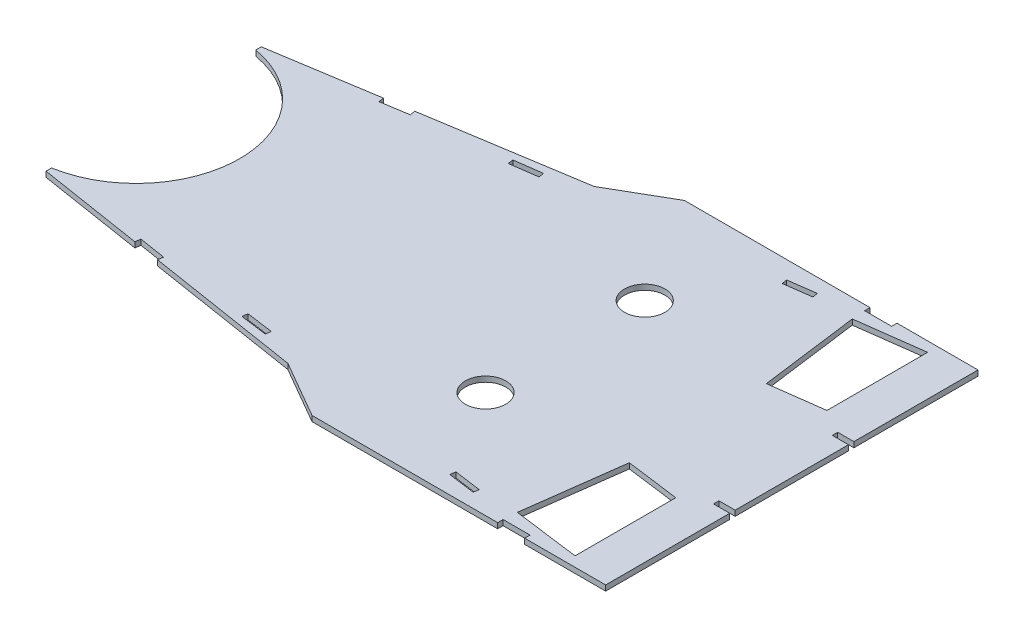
ISO-10303-21;
HEADER;
FILE_DESCRIPTION(('STEP AP214'),'2;1');
FILE_NAME('part.step','',(''),(''),'','','');
FILE_SCHEMA(('AUTOMOTIVE_DESIGN { 1 0 10303 214 1 1 1 1 }'));
ENDSEC;
DATA;
#1=APPLICATION_CONTEXT('core data for automotive mechanical design processes');
#2=APPLICATION_PROTOCOL_DEFINITION('international standard','automotive_design',2000,#1);
#3=PRODUCT_CONTEXT('',#1,'mechanical');
#4=PRODUCT('Part','Part','',(#3));
#5=PRODUCT_RELATED_PRODUCT_CATEGORY('part','',(#4));
#6=PRODUCT_DEFINITION_FORMATION('','',#4);
#7=PRODUCT_DEFINITION_CONTEXT('part definition',#1,'design');
#8=PRODUCT_DEFINITION('design','',#6,#7);
#9=PRODUCT_DEFINITION_SHAPE('','',#8);
#10=(LENGTH_UNIT() NAMED_UNIT(*) SI_UNIT(.MILLI.,.METRE.));
#11=(NAMED_UNIT(*) PLANE_ANGLE_UNIT() SI_UNIT($,.RADIAN.));
#12=(NAMED_UNIT(*) SI_UNIT($,.STERADIAN.) SOLID_ANGLE_UNIT());
#13=UNCERTAINTY_MEASURE_WITH_UNIT(LENGTH_MEASURE(1.E-05),#10,'distance_accuracy_value','');
#14=(GEOMETRIC_REPRESENTATION_CONTEXT(3) GLOBAL_UNCERTAINTY_ASSIGNED_CONTEXT((#13)) GLOBAL_UNIT_ASSIGNED_CONTEXT((#10,
#11,#12)) REPRESENTATION_CONTEXT('',''));
#15=CARTESIAN_POINT('',(0.,0.,0.));
#16=DIRECTION('',(0.,0.,1.));
#17=DIRECTION('',(1.,0.,0.));
#18=AXIS2_PLACEMENT_3D('',#15,#16,#17);
#19=CARTESIAN_POINT('',(0.,0.,0.));
#20=DIRECTION('',(0.,1.,0.));
#21=DIRECTION('',(0.,0.,1.));
#22=AXIS2_PLACEMENT_3D('',#19,#20,#21);
#23=PLANE('',#22);
#24=CARTESIAN_POINT('',(-84.,0.,-29.5));
#25=DIRECTION('',(0.,1.,0.));
#26=DIRECTION('',(0.,0.,1.));
#27=AXIS2_PLACEMENT_3D('',#24,#25,#26);
#28=CIRCLE('',#27,7.5);
#29=CARTESIAN_POINT('',(-84.,0.,-22.));
#30=VERTEX_POINT('',#29);
#31=EDGE_CURVE('E848',#30,#30,#28,.T.);
#32=ORIENTED_EDGE('',*,*,#31,.T.);
#33=EDGE_LOOP('',(#32));
#34=FACE_BOUND('',#33,.T.);
#35=CARTESIAN_POINT('',(-84.,0.,29.5));
#36=DIRECTION('',(0.,1.,0.));
#37=DIRECTION('',(0.,0.,1.));
#38=AXIS2_PLACEMENT_3D('',#35,#36,#37);
#39=CIRCLE('',#38,7.5);
#40=CARTESIAN_POINT('',(-84.,0.,37.));
#41=VERTEX_POINT('',#40);
#42=EDGE_CURVE('E553',#41,#41,#39,.T.);
#43=ORIENTED_EDGE('',*,*,#42,.T.);
#44=EDGE_LOOP('',(#43));
#45=FACE_BOUND('',#44,.T.);
#46=DIRECTION('',(-0.135715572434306,0.,-0.990747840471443));
#47=VECTOR('',#46,1.);
#48=CARTESIAN_POINT('',(-64.17083761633,0.,-61.43852487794));
#49=LINE('',#48,#47);
#50=CARTESIAN_POINT('',(-64.0351220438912,0.,-60.4477770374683));
#51=VERTEX_POINT('',#50);
#52=CARTESIAN_POINT('',(-64.3065531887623,0.,-62.4292727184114));
#53=VERTEX_POINT('',#52);
#54=EDGE_CURVE('E934',#51,#53,#49,.T.);
#55=ORIENTED_EDGE('',*,*,#54,.F.);
#56=DIRECTION('',(-0.990747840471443,0.,0.135715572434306));
#57=VECTOR('',#56,1.);
#58=CARTESIAN_POINT('',(-59.03184544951,0.,-61.13314067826));
#59=LINE('',#58,#57);
#60=CARTESIAN_POINT('',(-54.0285688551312,0.,-61.8185043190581));
#61=VERTEX_POINT('',#60);
#62=EDGE_CURVE('E939',#61,#51,#59,.T.);
#63=ORIENTED_EDGE('',*,*,#62,.F.);
#64=DIRECTION('',(0.135715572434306,0.,0.990747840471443));
#65=VECTOR('',#64,1.);
#66=CARTESIAN_POINT('',(-54.16428442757,0.,-62.80925215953));
#67=LINE('',#66,#65);
#68=CARTESIAN_POINT('',(-54.3000000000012,0.,-63.8000000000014));
#69=VERTEX_POINT('',#68);
#70=EDGE_CURVE('E923',#69,#61,#67,.T.);
#71=ORIENTED_EDGE('',*,*,#70,.F.);
#72=DIRECTION('',(0.990747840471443,0.,-0.135715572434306));
#73=VECTOR('',#72,1.);
#74=CARTESIAN_POINT('',(-59.30327659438,0.,-63.11463635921));
#75=LINE('',#74,#73);
#76=EDGE_CURVE('E929',#53,#69,#75,.T.);
#77=ORIENTED_EDGE('',*,*,#76,.F.);
#78=EDGE_LOOP('',(#55,#63,#71,#77));
#79=FACE_BOUND('',#78,.T.);
#80=DIRECTION('',(-0.135715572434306,0.,-0.990747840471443));
#81=VECTOR('',#80,1.);
#82=CARTESIAN_POINT('',(-153.4372180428,0.,-49.21055180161));
#83=LINE('',#82,#81);
#84=CARTESIAN_POINT('',(-153.301502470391,0.,-48.2198039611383));
#85=VERTEX_POINT('',#84);
#86=CARTESIAN_POINT('',(-153.572933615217,0.,-50.2012996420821));
#87=VERTEX_POINT('',#86);
#88=EDGE_CURVE('E913',#85,#87,#83,.T.);
#89=ORIENTED_EDGE('',*,*,#88,.F.);
#90=DIRECTION('',(-0.990747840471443,0.,0.135715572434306));
#91=VECTOR('',#90,1.);
#92=CARTESIAN_POINT('',(-148.298225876,0.,-48.90516760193));
#93=LINE('',#92,#91);
#94=CARTESIAN_POINT('',(-143.294949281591,0.,-49.5905312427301));
#95=VERTEX_POINT('',#94);
#96=EDGE_CURVE('E918',#95,#85,#93,.T.);
#97=ORIENTED_EDGE('',*,*,#96,.F.);
#98=DIRECTION('',(0.135715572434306,0.,0.990747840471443));
#99=VECTOR('',#98,1.);
#100=CARTESIAN_POINT('',(-143.430664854,0.,-50.5812790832));
#101=LINE('',#100,#99);
#102=CARTESIAN_POINT('',(-143.566380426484,0.,-51.5720269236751));
#103=VERTEX_POINT('',#102);
#104=EDGE_CURVE('E902',#103,#95,#101,.T.);
#105=ORIENTED_EDGE('',*,*,#104,.F.);
#106=DIRECTION('',(0.990747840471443,0.,-0.135715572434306));
#107=VECTOR('',#106,1.);
#108=CARTESIAN_POINT('',(-148.5696570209,0.,-50.88666328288));
#109=LINE('',#108,#107);
#110=EDGE_CURVE('E908',#87,#103,#109,.T.);
#111=ORIENTED_EDGE('',*,*,#110,.F.);
#112=EDGE_LOOP('',(#89,#97,#105,#111));
#113=FACE_BOUND('',#112,.T.);
#114=DIRECTION('',(0.990747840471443,0.,0.135715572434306));
#115=VECTOR('',#114,1.);
#116=CARTESIAN_POINT('',(-59.03184544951,0.,61.13314067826));
#117=LINE('',#116,#115);
#118=CARTESIAN_POINT('',(-64.0351220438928,0.,60.4477770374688));
#119=VERTEX_POINT('',#118);
#120=CARTESIAN_POINT('',(-54.028568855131,0.,61.8185043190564));
#121=VERTEX_POINT('',#120);
#122=EDGE_CURVE('E892',#119,#121,#117,.T.);
#123=ORIENTED_EDGE('',*,*,#122,.F.);
#124=DIRECTION('',(0.135715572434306,0.,-0.990747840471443));
#125=VECTOR('',#124,1.);
#126=CARTESIAN_POINT('',(-64.17083761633,0.,61.43852487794));
#127=LINE('',#126,#125);
#128=CARTESIAN_POINT('',(-64.3065531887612,0.,62.4292727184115));
#129=VERTEX_POINT('',#128);
#130=EDGE_CURVE('E897',#129,#119,#127,.T.);
#131=ORIENTED_EDGE('',*,*,#130,.F.);
#132=DIRECTION('',(-0.990747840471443,0.,-0.135715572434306));
#133=VECTOR('',#132,1.);
#134=CARTESIAN_POINT('',(-59.30327659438,0.,63.11463635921));
#135=LINE('',#134,#133);
#136=CARTESIAN_POINT('',(-54.3000000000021,0.,63.8000000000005));
#137=VERTEX_POINT('',#136);
#138=EDGE_CURVE('E881',#137,#129,#135,.T.);
#139=ORIENTED_EDGE('',*,*,#138,.F.);
#140=DIRECTION('',(-0.135715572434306,0.,0.990747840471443));
#141=VECTOR('',#140,1.);
#142=CARTESIAN_POINT('',(-54.16428442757,0.,62.80925215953));
#143=LINE('',#142,#141);
#144=EDGE_CURVE('E887',#121,#137,#143,.T.);
#145=ORIENTED_EDGE('',*,*,#144,.F.);
#146=EDGE_LOOP('',(#123,#131,#139,#145));
#147=FACE_BOUND('',#146,.T.);
#148=DIRECTION('',(0.990747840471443,0.,0.135715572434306));
#149=VECTOR('',#148,1.);
#150=CARTESIAN_POINT('',(-148.298225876,0.,48.90516760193));
#151=LINE('',#150,#149);
#152=CARTESIAN_POINT('',(-153.301502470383,0.,48.2198039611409));
#153=VERTEX_POINT('',#152);
#154=CARTESIAN_POINT('',(-143.294949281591,0.,49.5905312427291));
#155=VERTEX_POINT('',#154);
#156=EDGE_CURVE('E871',#153,#155,#151,.T.);
#157=ORIENTED_EDGE('',*,*,#156,.F.);
#158=DIRECTION('',(0.135715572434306,0.,-0.990747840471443));
#159=VECTOR('',#158,1.);
#160=CARTESIAN_POINT('',(-153.4372180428,0.,49.21055180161));
#161=LINE('',#160,#159);
#162=CARTESIAN_POINT('',(-153.572933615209,0.,50.2012996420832));
#163=VERTEX_POINT('',#162);
#164=EDGE_CURVE('E876',#163,#153,#161,.T.);
#165=ORIENTED_EDGE('',*,*,#164,.F.);
#166=DIRECTION('',(-0.990747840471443,0.,-0.135715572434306));
#167=VECTOR('',#166,1.);
#168=CARTESIAN_POINT('',(-148.5696570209,0.,50.88666328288));
#169=LINE('',#168,#167);
#170=CARTESIAN_POINT('',(-143.566380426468,0.,51.5720269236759));
#171=VERTEX_POINT('',#170);
#172=EDGE_CURVE('E854',#171,#163,#169,.T.);
#173=ORIENTED_EDGE('',*,*,#172,.F.);
#174=DIRECTION('',(-0.135715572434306,0.,0.990747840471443));
#175=VECTOR('',#174,1.);
#176=CARTESIAN_POINT('',(-143.430664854,0.,50.5812790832));
#177=LINE('',#176,#175);
#178=EDGE_CURVE('E866',#155,#171,#177,.T.);
#179=ORIENTED_EDGE('',*,*,#178,.F.);
#180=EDGE_LOOP('',(#157,#165,#173,#179));
#181=FACE_BOUND('',#180,.T.);
#182=DIRECTION('',(-0.130526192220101,0.,-0.991444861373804));
#183=VECTOR('',#182,1.);
#184=CARTESIAN_POINT('',(-37.24363178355,0.,-43.73120609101));
#185=LINE('',#184,#183);
#186=CARTESIAN_POINT('',(-34.8288972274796,0.,-25.3894761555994));
#187=VERTEX_POINT('',#186);
#188=CARTESIAN_POINT('',(-39.6583663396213,0.,-62.0729360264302));
#189=VERTEX_POINT('',#188);
#190=EDGE_CURVE('E976',#187,#189,#185,.T.);
#191=ORIENTED_EDGE('',*,*,#190,.F.);
#192=DIRECTION('',(-0.991444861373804,0.,0.130526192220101));
#193=VECTOR('',#192,1.);
#194=CARTESIAN_POINT('',(-24.91444861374,0.,-26.6947380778));
#195=LINE('',#194,#193);
#196=CARTESIAN_POINT('',(-15.,0.,-28.0000000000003));
#197=VERTEX_POINT('',#196);
#198=EDGE_CURVE('E559',#197,#187,#195,.T.);
#199=ORIENTED_EDGE('',*,*,#198,.F.);
#200=DIRECTION('',(0.,0.,1.));
#201=VECTOR('',#200,1.);
#202=CARTESIAN_POINT('',(-15.,0.,-46.65963577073));
#203=LINE('',#202,#201);
#204=CARTESIAN_POINT('',(-14.9999999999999,0.,-65.3192715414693));
#205=VERTEX_POINT('',#204);
#206=EDGE_CURVE('E965',#205,#197,#203,.T.);
#207=ORIENTED_EDGE('',*,*,#206,.F.);
#208=DIRECTION('',(0.991444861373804,0.,-0.130526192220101));
#209=VECTOR('',#208,1.);
#210=CARTESIAN_POINT('',(-27.32918316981,0.,-63.69610378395));
#211=LINE('',#210,#209);
#212=EDGE_CURVE('E971',#189,#205,#211,.T.);
#213=ORIENTED_EDGE('',*,*,#212,.F.);
#214=EDGE_LOOP('',(#191,#199,#207,#213));
#215=FACE_BOUND('',#214,.T.);
#216=DIRECTION('',(0.991444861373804,0.,0.130526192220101));
#217=VECTOR('',#216,1.);
#218=CARTESIAN_POINT('',(-24.91444861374,0.,26.6947380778));
#219=LINE('',#218,#217);
#220=CARTESIAN_POINT('',(-34.8288972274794,0.,25.3894761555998));
#221=VERTEX_POINT('',#220);
#222=CARTESIAN_POINT('',(-15.0000000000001,0.,28.0000000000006));
#223=VERTEX_POINT('',#222);
#224=EDGE_CURVE('E955',#221,#223,#219,.T.);
#225=ORIENTED_EDGE('',*,*,#224,.F.);
#226=DIRECTION('',(0.130526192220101,0.,-0.991444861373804));
#227=VECTOR('',#226,1.);
#228=CARTESIAN_POINT('',(-37.24363178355,0.,43.73120609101));
#229=LINE('',#228,#227);
#230=CARTESIAN_POINT('',(-39.6583663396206,0.,62.0729360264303));
#231=VERTEX_POINT('',#230);
#232=EDGE_CURVE('E960',#231,#221,#229,.T.);
#233=ORIENTED_EDGE('',*,*,#232,.F.);
#234=DIRECTION('',(-0.991444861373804,0.,-0.130526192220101));
#235=VECTOR('',#234,1.);
#236=CARTESIAN_POINT('',(-27.32918316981,0.,63.69610378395));
#237=LINE('',#236,#235);
#238=CARTESIAN_POINT('',(-15.,0.,65.3192715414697));
#239=VERTEX_POINT('',#238);
#240=EDGE_CURVE('E944',#239,#231,#237,.T.);
#241=ORIENTED_EDGE('',*,*,#240,.F.);
#242=DIRECTION('',(0.,0.,1.));
#243=VECTOR('',#242,1.);
#244=CARTESIAN_POINT('',(-15.,0.,46.65963577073));
#245=LINE('',#244,#243);
#246=EDGE_CURVE('E950',#223,#239,#245,.T.);
#247=ORIENTED_EDGE('',*,*,#246,.F.);
#248=EDGE_LOOP('',(#225,#233,#241,#247));
#249=FACE_BOUND('',#248,.T.);
#250=DIRECTION('',(-1.,0.,0.));
#251=VECTOR('',#250,1.);
#252=CARTESIAN_POINT('',(-3.,0.,21.));
#253=LINE('',#252,#251);
#254=CARTESIAN_POINT('',(0.,0.,21.));
#255=VERTEX_POINT('',#254);
#256=CARTESIAN_POINT('',(-6.,0.,21.));
#257=VERTEX_POINT('',#256);
#258=EDGE_CURVE('E599',#255,#257,#253,.T.);
#259=ORIENTED_EDGE('',*,*,#258,.T.);
#260=DIRECTION('',(0.,0.,-1.));
#261=VECTOR('',#260,1.);
#262=CARTESIAN_POINT('',(-6.,0.,22.));
#263=LINE('',#262,#261);
#264=CARTESIAN_POINT('',(-6.,0.,23.));
#265=VERTEX_POINT('',#264);
#266=EDGE_CURVE('E601',#265,#257,#263,.T.);
#267=ORIENTED_EDGE('',*,*,#266,.F.);
#268=DIRECTION('',(-1.,0.,0.));
#269=VECTOR('',#268,1.);
#270=CARTESIAN_POINT('',(-3.,0.,23.));
#271=LINE('',#270,#269);
#272=CARTESIAN_POINT('',(0.,0.,23.));
#273=VERTEX_POINT('',#272);
#274=EDGE_CURVE('E619',#273,#265,#271,.T.);
#275=ORIENTED_EDGE('',*,*,#274,.F.);
#276=DIRECTION('',(0.,0.,-1.));
#277=VECTOR('',#276,1.);
#278=CARTESIAN_POINT('',(0.,0.,0.));
#279=LINE('',#278,#277);
#280=CARTESIAN_POINT('',(0.,0.,69.));
#281=VERTEX_POINT('',#280);
#282=EDGE_CURVE('E638',#281,#273,#279,.T.);
#283=ORIENTED_EDGE('',*,*,#282,.F.);
#284=DIRECTION('',(1.,0.,0.));
#285=VECTOR('',#284,1.);
#286=CARTESIAN_POINT('',(-54.4,0.,69.));
#287=LINE('',#286,#285);
#288=CARTESIAN_POINT('',(-30.,0.,69.));
#289=VERTEX_POINT('',#288);
#290=EDGE_CURVE('E655',#289,#281,#287,.T.);
#291=ORIENTED_EDGE('',*,*,#290,.F.);
#292=DIRECTION('',(0.,0.,-1.));
#293=VECTOR('',#292,1.);
#294=CARTESIAN_POINT('',(-30.,0.,68.));
#295=LINE('',#294,#293);
#296=CARTESIAN_POINT('',(-30.,0.,67.));
#297=VERTEX_POINT('',#296);
#298=EDGE_CURVE('E665',#289,#297,#295,.T.);
#299=ORIENTED_EDGE('',*,*,#298,.T.);
#300=DIRECTION('',(1.,0.,0.));
#301=VECTOR('',#300,1.);
#302=CARTESIAN_POINT('',(-35.,0.,67.));
#303=LINE('',#302,#301);
#304=CARTESIAN_POINT('',(-40.,0.,67.));
#305=VERTEX_POINT('',#304);
#306=EDGE_CURVE('E667',#305,#297,#303,.T.);
#307=ORIENTED_EDGE('',*,*,#306,.F.);
#308=DIRECTION('',(0.,0.,-1.));
#309=VECTOR('',#308,1.);
#310=CARTESIAN_POINT('',(-40.,0.,68.));
#311=LINE('',#310,#309);
#312=CARTESIAN_POINT('',(-40.,0.,69.));
#313=VERTEX_POINT('',#312);
#314=EDGE_CURVE('E684',#313,#305,#311,.T.);
#315=ORIENTED_EDGE('',*,*,#314,.F.);
#316=DIRECTION('',(1.,0.,0.));
#317=VECTOR('',#316,1.);
#318=CARTESIAN_POINT('',(-54.4,0.,69.));
#319=LINE('',#318,#317);
#320=CARTESIAN_POINT('',(-108.8,0.,69.0000000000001));
#321=VERTEX_POINT('',#320);
#322=EDGE_CURVE('E704',#321,#313,#319,.T.);
#323=ORIENTED_EDGE('',*,*,#322,.F.);
#324=DIRECTION('',(0.866025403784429,0.,0.500000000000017));
#325=VECTOR('',#324,1.);
#326=CARTESIAN_POINT('',(-119.4,0.,62.88008714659));
#327=LINE('',#326,#325);
#328=CARTESIAN_POINT('',(-130.,0.,56.7601742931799));
#329=VERTEX_POINT('',#328);
#330=EDGE_CURVE('E718',#329,#321,#327,.T.);
#331=ORIENTED_EDGE('',*,*,#330,.F.);
#332=DIRECTION('',(0.987688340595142,0.,0.156434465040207));
#333=VECTOR('',#332,1.);
#334=CARTESIAN_POINT('',(-183.25,0.,48.3262028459));
#335=LINE('',#334,#333);
#336=CARTESIAN_POINT('',(-187.411889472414,0.,47.6670243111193));
#337=VERTEX_POINT('',#336);
#338=EDGE_CURVE('E735',#337,#329,#335,.T.);
#339=ORIENTED_EDGE('',*,*,#338,.F.);
#340=DIRECTION('',(-0.156434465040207,0.,0.987688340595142));
#341=VECTOR('',#340,1.);
#342=CARTESIAN_POINT('',(-187.2554550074,0.,46.67933597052));
#343=LINE('',#342,#341);
#344=CARTESIAN_POINT('',(-187.099020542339,0.,45.6916476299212));
#345=VERTEX_POINT('',#344);
#346=EDGE_CURVE('E737',#345,#337,#343,.T.);
#347=ORIENTED_EDGE('',*,*,#346,.F.);
#348=DIRECTION('',(0.987688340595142,0.,0.156434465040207));
#349=VECTOR('',#348,1.);
#350=CARTESIAN_POINT('',(-192.0868466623,0.,44.90165358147));
#351=LINE('',#350,#349);
#352=CARTESIAN_POINT('',(-197.074672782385,0.,44.1116595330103));
#353=VERTEX_POINT('',#352);
#354=EDGE_CURVE('E756',#353,#345,#351,.T.);
#355=ORIENTED_EDGE('',*,*,#354,.F.);
#356=DIRECTION('',(0.156434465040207,0.,-0.987688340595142));
#357=VECTOR('',#356,1.);
#358=CARTESIAN_POINT('',(-197.2311072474,0.,45.09934787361));
#359=LINE('',#358,#357);
#360=CARTESIAN_POINT('',(-197.387541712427,0.,46.0870362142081));
#361=VERTEX_POINT('',#360);
#362=EDGE_CURVE('E775',#361,#353,#359,.T.);
#363=ORIENTED_EDGE('',*,*,#362,.F.);
#364=DIRECTION('',(0.987688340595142,0.,0.156434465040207));
#365=VECTOR('',#364,1.);
#366=CARTESIAN_POINT('',(-183.25,0.,48.3262028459));
#367=LINE('',#366,#365);
#368=CARTESIAN_POINT('',(-236.5,0.,39.8922313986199));
#369=VERTEX_POINT('',#368);
#370=EDGE_CURVE('E789',#369,#361,#367,.T.);
#371=ORIENTED_EDGE('',*,*,#370,.F.);
#372=DIRECTION('',(0.,0.,1.));
#373=VECTOR('',#372,1.);
#374=CARTESIAN_POINT('',(-236.5,0.,38.86905151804));
#375=LINE('',#374,#373);
#376=CARTESIAN_POINT('',(-236.5,0.,37.8458716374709));
#377=VERTEX_POINT('',#376);
#378=EDGE_CURVE('E385',#377,#369,#375,.T.);
#379=ORIENTED_EDGE('',*,*,#378,.F.);
#380=CARTESIAN_POINT('',(-243.,0.,0.));
#381=DIRECTION('',(0.,-1.,0.));
#382=DIRECTION('',(0.,0.,-1.));
#383=AXIS2_PLACEMENT_3D('',#380,#381,#382);
#384=CIRCLE('',#383,38.4);
#385=CARTESIAN_POINT('',(-236.5,0.,-37.8458716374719));
#386=VERTEX_POINT('',#385);
#387=EDGE_CURVE('E19',#377,#386,#384,.F.);
#388=ORIENTED_EDGE('',*,*,#387,.T.);
#389=DIRECTION('',(0.,0.,1.));
#390=VECTOR('',#389,1.);
#391=CARTESIAN_POINT('',(-236.5,0.,-38.86905151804));
#392=LINE('',#391,#390);
#393=CARTESIAN_POINT('',(-236.5,0.,-39.8922313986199));
#394=VERTEX_POINT('',#393);
#395=EDGE_CURVE('E382',#394,#386,#392,.T.);
#396=ORIENTED_EDGE('',*,*,#395,.F.);
#397=DIRECTION('',(-0.987688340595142,0.,0.156434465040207));
#398=VECTOR('',#397,1.);
#399=CARTESIAN_POINT('',(-183.25,0.,-48.3262028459));
#400=LINE('',#399,#398);
#401=CARTESIAN_POINT('',(-197.387541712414,0.,-46.0870362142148));
#402=VERTEX_POINT('',#401);
#403=EDGE_CURVE('E418',#402,#394,#400,.T.);
#404=ORIENTED_EDGE('',*,*,#403,.F.);
#405=DIRECTION('',(-0.156434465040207,0.,-0.987688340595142));
#406=VECTOR('',#405,1.);
#407=CARTESIAN_POINT('',(-197.2311072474,0.,-45.09934787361));
#408=LINE('',#407,#406);
#409=CARTESIAN_POINT('',(-197.074672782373,0.,-44.1116595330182));
#410=VERTEX_POINT('',#409);
#411=EDGE_CURVE('E429',#410,#402,#408,.T.);
#412=ORIENTED_EDGE('',*,*,#411,.F.);
#413=DIRECTION('',(-0.987688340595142,0.,0.156434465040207));
#414=VECTOR('',#413,1.);
#415=CARTESIAN_POINT('',(-192.0868466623,0.,-44.90165358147));
#416=LINE('',#415,#414);
#417=CARTESIAN_POINT('',(-187.099020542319,0.,-45.6916476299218));
#418=VERTEX_POINT('',#417);
#419=EDGE_CURVE('E430',#418,#410,#416,.T.);
#420=ORIENTED_EDGE('',*,*,#419,.F.);
#421=DIRECTION('',(0.156434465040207,0.,0.987688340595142));
#422=VECTOR('',#421,1.);
#423=CARTESIAN_POINT('',(-187.2554550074,0.,-46.67933597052));
#424=LINE('',#423,#422);
#425=CARTESIAN_POINT('',(-187.411889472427,0.,-47.6670243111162));
#426=VERTEX_POINT('',#425);
#427=EDGE_CURVE('E441',#426,#418,#424,.T.);
#428=ORIENTED_EDGE('',*,*,#427,.F.);
#429=DIRECTION('',(-0.987688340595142,0.,0.156434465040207));
#430=VECTOR('',#429,1.);
#431=CARTESIAN_POINT('',(-183.25,0.,-48.3262028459));
#432=LINE('',#431,#430);
#433=CARTESIAN_POINT('',(-130.,0.,-56.7601742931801));
#434=VERTEX_POINT('',#433);
#435=EDGE_CURVE('E452',#434,#426,#432,.T.);
#436=ORIENTED_EDGE('',*,*,#435,.F.);
#437=DIRECTION('',(-0.866025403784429,0.,0.500000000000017));
#438=VECTOR('',#437,1.);
#439=CARTESIAN_POINT('',(-119.4,0.,-62.88008714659));
#440=LINE('',#439,#438);
#441=CARTESIAN_POINT('',(-108.8,0.,-69.0000000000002));
#442=VERTEX_POINT('',#441);
#443=EDGE_CURVE('E463',#442,#434,#440,.T.);
#444=ORIENTED_EDGE('',*,*,#443,.F.);
#445=DIRECTION('',(-1.,0.,0.));
#446=VECTOR('',#445,1.);
#447=CARTESIAN_POINT('',(-54.4,0.,-69.));
#448=LINE('',#447,#446);
#449=CARTESIAN_POINT('',(-40.,0.,-69.));
#450=VERTEX_POINT('',#449);
#451=EDGE_CURVE('E484',#450,#442,#448,.T.);
#452=ORIENTED_EDGE('',*,*,#451,.F.);
#453=DIRECTION('',(0.,0.,1.));
#454=VECTOR('',#453,1.);
#455=CARTESIAN_POINT('',(-40.,0.,-68.));
#456=LINE('',#455,#454);
#457=CARTESIAN_POINT('',(-40.,0.,-67.));
#458=VERTEX_POINT('',#457);
#459=EDGE_CURVE('E494',#450,#458,#456,.T.);
#460=ORIENTED_EDGE('',*,*,#459,.T.);
#461=DIRECTION('',(-1.,0.,0.));
#462=VECTOR('',#461,1.);
#463=CARTESIAN_POINT('',(-35.,0.,-67.));
#464=LINE('',#463,#462);
#465=CARTESIAN_POINT('',(-30.,0.,-67.));
#466=VERTEX_POINT('',#465);
#467=EDGE_CURVE('E505',#466,#458,#464,.T.);
#468=ORIENTED_EDGE('',*,*,#467,.F.);
#469=DIRECTION('',(0.,0.,1.));
#470=VECTOR('',#469,1.);
#471=CARTESIAN_POINT('',(-30.,0.,-68.));
#472=LINE('',#471,#470);
#473=CARTESIAN_POINT('',(-30.,0.,-69.));
#474=VERTEX_POINT('',#473);
#475=EDGE_CURVE('E506',#474,#466,#472,.T.);
#476=ORIENTED_EDGE('',*,*,#475,.F.);
#477=DIRECTION('',(-1.,0.,0.));
#478=VECTOR('',#477,1.);
#479=CARTESIAN_POINT('',(-54.4,0.,-69.));
#480=LINE('',#479,#478);
#481=CARTESIAN_POINT('',(0.,0.,-69.));
#482=VERTEX_POINT('',#481);
#483=EDGE_CURVE('E517',#482,#474,#480,.T.);
#484=ORIENTED_EDGE('',*,*,#483,.F.);
#485=DIRECTION('',(0.,0.,-1.));
#486=VECTOR('',#485,1.);
#487=CARTESIAN_POINT('',(0.,0.,0.));
#488=LINE('',#487,#486);
#489=CARTESIAN_POINT('',(0.,0.,-23.));
#490=VERTEX_POINT('',#489);
#491=EDGE_CURVE('E538',#490,#482,#488,.T.);
#492=ORIENTED_EDGE('',*,*,#491,.F.);
#493=DIRECTION('',(-1.,0.,0.));
#494=VECTOR('',#493,1.);
#495=CARTESIAN_POINT('',(-3.,0.,-23.));
#496=LINE('',#495,#494);
#497=CARTESIAN_POINT('',(-6.,0.,-23.));
#498=VERTEX_POINT('',#497);
#499=EDGE_CURVE('E548',#490,#498,#496,.T.);
#500=ORIENTED_EDGE('',*,*,#499,.T.);
#501=DIRECTION('',(0.,0.,-1.));
#502=VECTOR('',#501,1.);
#503=CARTESIAN_POINT('',(-6.,0.,-22.));
#504=LINE('',#503,#502);
#505=CARTESIAN_POINT('',(-6.,0.,-21.));
#506=VERTEX_POINT('',#505);
#507=EDGE_CURVE('E570',#506,#498,#504,.T.);
#508=ORIENTED_EDGE('',*,*,#507,.F.);
#509=DIRECTION('',(-1.,0.,0.));
#510=VECTOR('',#509,1.);
#511=CARTESIAN_POINT('',(-3.,0.,-21.));
#512=LINE('',#511,#510);
#513=CARTESIAN_POINT('',(0.,0.,-21.));
#514=VERTEX_POINT('',#513);
#515=EDGE_CURVE('E560',#514,#506,#512,.T.);
#516=ORIENTED_EDGE('',*,*,#515,.F.);
#517=DIRECTION('',(0.,0.,-1.));
#518=VECTOR('',#517,1.);
#519=CARTESIAN_POINT('',(0.,0.,0.));
#520=LINE('',#519,#518);
#521=EDGE_CURVE('E582',#255,#514,#520,.T.);
#522=ORIENTED_EDGE('',*,*,#521,.F.);
#523=EDGE_LOOP('',(#259,#267,#275,#283,#291,#299,#307,#315,#323,#331,#339,#347,#355,#363,#371,
#379,#388,#396,#404,#412,#420,#428,#436,#444,#452,#460,#468,#476,#484,#492,#500,#508,#516,#522));
#524=FACE_BOUND('',#523,.T.);
#525=ADVANCED_FACE('F16',(#34,#45,#79,#113,#147,#181,#215,#249,#524),#23,.F.);
#526=CARTESIAN_POINT('',(-6.,1.,-22.));
#527=DIRECTION('',(1.,0.,0.));
#528=DIRECTION('',(0.,0.,-1.));
#529=AXIS2_PLACEMENT_3D('',#526,#527,#528);
#530=PLANE('',#529);
#531=DIRECTION('',(0.,1.,0.));
#532=VECTOR('',#531,1.);
#533=CARTESIAN_POINT('',(-6.,1.,-23.));
#534=LINE('',#533,#532);
#535=CARTESIAN_POINT('',(-6.,2.,-23.));
#536=VERTEX_POINT('',#535);
#537=EDGE_CURVE('E546',#498,#536,#534,.T.);
#538=ORIENTED_EDGE('',*,*,#537,.T.);
#539=DIRECTION('',(0.,0.,1.));
#540=VECTOR('',#539,1.);
#541=CARTESIAN_POINT('',(-6.,2.,0.));
#542=LINE('',#541,#540);
#543=CARTESIAN_POINT('',(-6.,2.,-21.));
#544=VERTEX_POINT('',#543);
#545=EDGE_CURVE('E543',#544,#536,#542,.F.);
#546=ORIENTED_EDGE('',*,*,#545,.F.);
#547=DIRECTION('',(0.,1.,0.));
#548=VECTOR('',#547,1.);
#549=CARTESIAN_POINT('',(-6.,1.,-21.));
#550=LINE('',#549,#548);
#551=EDGE_CURVE('E556',#506,#544,#550,.T.);
#552=ORIENTED_EDGE('',*,*,#551,.F.);
#553=ORIENTED_EDGE('',*,*,#507,.T.);
#554=EDGE_LOOP('',(#538,#546,#552,#553));
#555=FACE_BOUND('',#554,.T.);
#556=ADVANCED_FACE('F1059',(#555),#530,.T.);
#557=CARTESIAN_POINT('',(-3.,1.,-23.));
#558=DIRECTION('',(0.,0.,-1.));
#559=DIRECTION('',(-1.,0.,0.));
#560=AXIS2_PLACEMENT_3D('',#557,#558,#559);
#561=PLANE('',#560);
#562=ORIENTED_EDGE('',*,*,#499,.F.);
#563=DIRECTION('',(0.,1.,0.));
#564=VECTOR('',#563,1.);
#565=CARTESIAN_POINT('',(0.,1.,-23.));
#566=LINE('',#565,#564);
#567=CARTESIAN_POINT('',(0.,2.,-23.));
#568=VERTEX_POINT('',#567);
#569=EDGE_CURVE('E528',#568,#490,#566,.F.);
#570=ORIENTED_EDGE('',*,*,#569,.F.);
#571=DIRECTION('',(1.,0.,0.));
#572=VECTOR('',#571,1.);
#573=CARTESIAN_POINT('',(0.,2.,-23.));
#574=LINE('',#573,#572);
#575=EDGE_CURVE('E533',#536,#568,#574,.T.);
#576=ORIENTED_EDGE('',*,*,#575,.F.);
#577=ORIENTED_EDGE('',*,*,#537,.F.);
#578=EDGE_LOOP('',(#562,#570,#576,#577));
#579=FACE_BOUND('',#578,.T.);
#580=ADVANCED_FACE('F1056',(#579),#561,.F.);
#581=CARTESIAN_POINT('',(0.,1.,0.));
#582=DIRECTION('',(1.,0.,0.));
#583=DIRECTION('',(0.,0.,-1.));
#584=AXIS2_PLACEMENT_3D('',#581,#582,#583);
#585=PLANE('',#584);
#586=DIRECTION('',(0.,0.,1.));
#587=VECTOR('',#586,1.);
#588=CARTESIAN_POINT('',(0.,2.,0.));
#589=LINE('',#588,#587);
#590=CARTESIAN_POINT('',(0.,2.,-69.));
#591=VERTEX_POINT('',#590);
#592=EDGE_CURVE('E522',#568,#591,#589,.F.);
#593=ORIENTED_EDGE('',*,*,#592,.F.);
#594=ORIENTED_EDGE('',*,*,#569,.T.);
#595=ORIENTED_EDGE('',*,*,#491,.T.);
#596=DIRECTION('',(0.,1.,0.));
#597=VECTOR('',#596,1.);
#598=CARTESIAN_POINT('',(0.,1.,-69.));
#599=LINE('',#598,#597);
#600=EDGE_CURVE('E525',#591,#482,#599,.F.);
#601=ORIENTED_EDGE('',*,*,#600,.F.);
#602=EDGE_LOOP('',(#593,#594,#595,#601));
#603=FACE_BOUND('',#602,.T.);
#604=ADVANCED_FACE('F1052',(#603),#585,.T.);
#605=CARTESIAN_POINT('',(-54.4,1.,-69.));
#606=DIRECTION('',(0.,0.,-1.));
#607=DIRECTION('',(-1.,0.,0.));
#608=AXIS2_PLACEMENT_3D('',#605,#606,#607);
#609=PLANE('',#608);
#610=ORIENTED_EDGE('',*,*,#483,.T.);
#611=DIRECTION('',(0.,1.,0.));
#612=VECTOR('',#611,1.);
#613=CARTESIAN_POINT('',(-30.,1.,-69.));
#614=LINE('',#613,#612);
#615=CARTESIAN_POINT('',(-30.,2.,-69.));
#616=VERTEX_POINT('',#615);
#617=EDGE_CURVE('E514',#616,#474,#614,.F.);
#618=ORIENTED_EDGE('',*,*,#617,.F.);
#619=DIRECTION('',(1.,0.,0.));
#620=VECTOR('',#619,1.);
#621=CARTESIAN_POINT('',(0.,2.,-69.));
#622=LINE('',#621,#620);
#623=EDGE_CURVE('E511',#591,#616,#622,.F.);
#624=ORIENTED_EDGE('',*,*,#623,.F.);
#625=ORIENTED_EDGE('',*,*,#600,.T.);
#626=EDGE_LOOP('',(#610,#618,#624,#625));
#627=FACE_BOUND('',#626,.T.);
#628=ADVANCED_FACE('F1049',(#627),#609,.T.);
#629=CARTESIAN_POINT('',(-30.,1.,-68.));
#630=DIRECTION('',(-1.,0.,0.));
#631=DIRECTION('',(0.,0.,1.));
#632=AXIS2_PLACEMENT_3D('',#629,#630,#631);
#633=PLANE('',#632);
#634=DIRECTION('',(0.,1.,0.));
#635=VECTOR('',#634,1.);
#636=CARTESIAN_POINT('',(-30.,1.,-67.));
#637=LINE('',#636,#635);
#638=CARTESIAN_POINT('',(-30.,2.,-67.));
#639=VERTEX_POINT('',#638);
#640=EDGE_CURVE('E502',#639,#466,#637,.F.);
#641=ORIENTED_EDGE('',*,*,#640,.F.);
#642=DIRECTION('',(0.,0.,1.));
#643=VECTOR('',#642,1.);
#644=CARTESIAN_POINT('',(-30.,2.,0.));
#645=LINE('',#644,#643);
#646=EDGE_CURVE('E499',#616,#639,#645,.T.);
#647=ORIENTED_EDGE('',*,*,#646,.F.);
#648=ORIENTED_EDGE('',*,*,#617,.T.);
#649=ORIENTED_EDGE('',*,*,#475,.T.);
#650=EDGE_LOOP('',(#641,#647,#648,#649));
#651=FACE_BOUND('',#650,.T.);
#652=ADVANCED_FACE('F1046',(#651),#633,.T.);
#653=CARTESIAN_POINT('',(-35.,1.,-67.));
#654=DIRECTION('',(0.,0.,-1.));
#655=DIRECTION('',(-1.,0.,0.));
#656=AXIS2_PLACEMENT_3D('',#653,#654,#655);
#657=PLANE('',#656);
#658=DIRECTION('',(0.,1.,0.));
#659=VECTOR('',#658,1.);
#660=CARTESIAN_POINT('',(-40.,1.,-67.));
#661=LINE('',#660,#659);
#662=CARTESIAN_POINT('',(-40.,2.,-67.));
#663=VERTEX_POINT('',#662);
#664=EDGE_CURVE('E492',#458,#663,#661,.T.);
#665=ORIENTED_EDGE('',*,*,#664,.T.);
#666=DIRECTION('',(1.,0.,0.));
#667=VECTOR('',#666,1.);
#668=CARTESIAN_POINT('',(0.,2.,-67.));
#669=LINE('',#668,#667);
#670=EDGE_CURVE('E489',#639,#663,#669,.F.);
#671=ORIENTED_EDGE('',*,*,#670,.F.);
#672=ORIENTED_EDGE('',*,*,#640,.T.);
#673=ORIENTED_EDGE('',*,*,#467,.T.);
#674=EDGE_LOOP('',(#665,#671,#672,#673));
#675=FACE_BOUND('',#674,.T.);
#676=ADVANCED_FACE('F1042',(#675),#657,.T.);
#677=CARTESIAN_POINT('',(-40.,1.,-68.));
#678=DIRECTION('',(-1.,0.,0.));
#679=DIRECTION('',(0.,0.,1.));
#680=AXIS2_PLACEMENT_3D('',#677,#678,#679);
#681=PLANE('',#680);
#682=ORIENTED_EDGE('',*,*,#459,.F.);
#683=DIRECTION('',(0.,1.,0.));
#684=VECTOR('',#683,1.);
#685=CARTESIAN_POINT('',(-40.,1.,-69.));
#686=LINE('',#685,#684);
#687=CARTESIAN_POINT('',(-40.,2.,-69.));
#688=VERTEX_POINT('',#687);
#689=EDGE_CURVE('E474',#688,#450,#686,.F.);
#690=ORIENTED_EDGE('',*,*,#689,.F.);
#691=DIRECTION('',(0.,0.,1.));
#692=VECTOR('',#691,1.);
#693=CARTESIAN_POINT('',(-40.,2.,0.));
#694=LINE('',#693,#692);
#695=EDGE_CURVE('E479',#663,#688,#694,.F.);
#696=ORIENTED_EDGE('',*,*,#695,.F.);
#697=ORIENTED_EDGE('',*,*,#664,.F.);
#698=EDGE_LOOP('',(#682,#690,#696,#697));
#699=FACE_BOUND('',#698,.T.);
#700=ADVANCED_FACE('F1035',(#699),#681,.F.);
#701=CARTESIAN_POINT('',(-54.4,1.,-69.));
#702=DIRECTION('',(0.,0.,-1.));
#703=DIRECTION('',(-1.,0.,0.));
#704=AXIS2_PLACEMENT_3D('',#701,#702,#703);
#705=PLANE('',#704);
#706=DIRECTION('',(1.,0.,0.));
#707=VECTOR('',#706,1.);
#708=CARTESIAN_POINT('',(0.,2.,-69.));
#709=LINE('',#708,#707);
#710=CARTESIAN_POINT('',(-108.8,2.,-69.0000000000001));
#711=VERTEX_POINT('',#710);
#712=EDGE_CURVE('E468',#688,#711,#709,.F.);
#713=ORIENTED_EDGE('',*,*,#712,.F.);
#714=ORIENTED_EDGE('',*,*,#689,.T.);
#715=ORIENTED_EDGE('',*,*,#451,.T.);
#716=DIRECTION('',(0.,1.,0.));
#717=VECTOR('',#716,1.);
#718=CARTESIAN_POINT('',(-108.8,1.,-69.0000000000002));
#719=LINE('',#718,#717);
#720=EDGE_CURVE('E471',#711,#442,#719,.F.);
#721=ORIENTED_EDGE('',*,*,#720,.F.);
#722=EDGE_LOOP('',(#713,#714,#715,#721));
#723=FACE_BOUND('',#722,.T.);
#724=ADVANCED_FACE('F1038',(#723),#705,.T.);
#725=CARTESIAN_POINT('',(-119.4,1.,-62.88008714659));
#726=DIRECTION('',(-0.500000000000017,0.,-0.866025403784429));
#727=DIRECTION('',(-0.866025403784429,0.,0.500000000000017));
#728=AXIS2_PLACEMENT_3D('',#725,#726,#727);
#729=PLANE('',#728);
#730=DIRECTION('',(0.,1.,0.));
#731=VECTOR('',#730,1.);
#732=CARTESIAN_POINT('',(-130.,1.,-56.7601742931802));
#733=LINE('',#732,#731);
#734=CARTESIAN_POINT('',(-130.,2.,-56.7601742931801));
#735=VERTEX_POINT('',#734);
#736=EDGE_CURVE('E460',#735,#434,#733,.F.);
#737=ORIENTED_EDGE('',*,*,#736,.F.);
#738=DIRECTION('',(-0.86602540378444,0.,0.499999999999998));
#739=VECTOR('',#738,1.);
#740=CARTESIAN_POINT('',(-108.8,2.,-69.));
#741=LINE('',#740,#739);
#742=EDGE_CURVE('E457',#711,#735,#741,.T.);
#743=ORIENTED_EDGE('',*,*,#742,.F.);
#744=ORIENTED_EDGE('',*,*,#720,.T.);
#745=ORIENTED_EDGE('',*,*,#443,.T.);
#746=EDGE_LOOP('',(#737,#743,#744,#745));
#747=FACE_BOUND('',#746,.T.);
#748=ADVANCED_FACE('F1029',(#747),#729,.T.);
#749=CARTESIAN_POINT('',(-183.25,1.,-48.3262028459));
#750=DIRECTION('',(-0.156434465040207,0.,-0.987688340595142));
#751=DIRECTION('',(-0.987688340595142,0.,0.156434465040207));
#752=AXIS2_PLACEMENT_3D('',#749,#750,#751);
#753=PLANE('',#752);
#754=ORIENTED_EDGE('',*,*,#435,.T.);
#755=DIRECTION('',(0.,1.,0.));
#756=VECTOR('',#755,1.);
#757=CARTESIAN_POINT('',(-187.41188947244,1.,-47.6670243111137));
#758=LINE('',#757,#756);
#759=CARTESIAN_POINT('',(-187.411889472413,2.,-47.6670243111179));
#760=VERTEX_POINT('',#759);
#761=EDGE_CURVE('E449',#760,#426,#758,.F.);
#762=ORIENTED_EDGE('',*,*,#761,.F.);
#763=DIRECTION('',(-0.987688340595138,0.,0.156434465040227));
#764=VECTOR('',#763,1.);
#765=CARTESIAN_POINT('',(-130.,2.,-56.76017429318));
#766=LINE('',#765,#764);
#767=EDGE_CURVE('E446',#735,#760,#766,.T.);
#768=ORIENTED_EDGE('',*,*,#767,.F.);
#769=ORIENTED_EDGE('',*,*,#736,.T.);
#770=EDGE_LOOP('',(#754,#762,#768,#769));
#771=FACE_BOUND('',#770,.T.);
#772=ADVANCED_FACE('F1026',(#771),#753,.T.);
#773=CARTESIAN_POINT('',(-187.2554550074,1.,-46.67933597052));
#774=DIRECTION('',(-0.987688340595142,0.,0.156434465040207));
#775=DIRECTION('',(0.156434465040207,0.,0.987688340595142));
#776=AXIS2_PLACEMENT_3D('',#773,#774,#775);
#777=PLANE('',#776);
#778=DIRECTION('',(0.,1.,0.));
#779=VECTOR('',#778,1.);
#780=CARTESIAN_POINT('',(-187.099020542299,1.,-45.6916476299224));
#781=LINE('',#780,#779);
#782=CARTESIAN_POINT('',(-187.0990205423,2.,-45.6916476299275));
#783=VERTEX_POINT('',#782);
#784=EDGE_CURVE('E438',#783,#418,#781,.F.);
#785=ORIENTED_EDGE('',*,*,#784,.F.);
#786=DIRECTION('',(0.156434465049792,0.,0.987688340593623));
#787=VECTOR('',#786,1.);
#788=CARTESIAN_POINT('',(-187.4118894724,2.,-47.66702431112));
#789=LINE('',#788,#787);
#790=EDGE_CURVE('E435',#760,#783,#789,.T.);
#791=ORIENTED_EDGE('',*,*,#790,.F.);
#792=ORIENTED_EDGE('',*,*,#761,.T.);
#793=ORIENTED_EDGE('',*,*,#427,.T.);
#794=EDGE_LOOP('',(#785,#791,#792,#793));
#795=FACE_BOUND('',#794,.T.);
#796=ADVANCED_FACE('F1023',(#795),#777,.T.);
#797=CARTESIAN_POINT('',(-192.0868466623,1.,-44.90165358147));
#798=DIRECTION('',(-0.156434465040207,0.,-0.987688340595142));
#799=DIRECTION('',(-0.987688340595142,0.,0.156434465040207));
#800=AXIS2_PLACEMENT_3D('',#797,#798,#799);
#801=PLANE('',#800);
#802=DIRECTION('',(0.,1.,0.));
#803=VECTOR('',#802,1.);
#804=CARTESIAN_POINT('',(-197.074672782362,1.,-44.1116595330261));
#805=LINE('',#804,#803);
#806=CARTESIAN_POINT('',(-197.074672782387,2.,-44.111659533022));
#807=VERTEX_POINT('',#806);
#808=EDGE_CURVE('E426',#807,#410,#805,.F.);
#809=ORIENTED_EDGE('',*,*,#808,.F.);
#810=DIRECTION('',(-0.987688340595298,0.,0.156434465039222));
#811=VECTOR('',#810,1.);
#812=CARTESIAN_POINT('',(-187.0990205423,2.,-45.69164762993));
#813=LINE('',#812,#811);
#814=EDGE_CURVE('E423',#783,#807,#813,.T.);
#815=ORIENTED_EDGE('',*,*,#814,.F.);
#816=ORIENTED_EDGE('',*,*,#784,.T.);
#817=ORIENTED_EDGE('',*,*,#419,.T.);
#818=EDGE_LOOP('',(#809,#815,#816,#817));
#819=FACE_BOUND('',#818,.T.);
#820=ADVANCED_FACE('F1017',(#819),#801,.T.);
#821=CARTESIAN_POINT('',(-197.2311072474,1.,-45.09934787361));
#822=DIRECTION('',(0.987688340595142,0.,-0.156434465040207));
#823=DIRECTION('',(-0.156434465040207,0.,-0.987688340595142));
#824=AXIS2_PLACEMENT_3D('',#821,#822,#823);
#825=PLANE('',#824);
#826=DIRECTION('',(0.,1.,0.));
#827=VECTOR('',#826,1.);
#828=CARTESIAN_POINT('',(-197.387541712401,1.,-46.0870362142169));
#829=LINE('',#828,#827);
#830=CARTESIAN_POINT('',(-197.3875417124,2.,-46.0870362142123));
#831=VERTEX_POINT('',#830);
#832=EDGE_CURVE('E406',#831,#402,#829,.F.);
#833=ORIENTED_EDGE('',*,*,#832,.F.);
#834=DIRECTION('',(-0.156434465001,0.,-0.987688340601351));
#835=VECTOR('',#834,1.);
#836=CARTESIAN_POINT('',(-197.0746727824,2.,-44.11165953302));
#837=LINE('',#836,#835);
#838=EDGE_CURVE('E413',#807,#831,#837,.T.);
#839=ORIENTED_EDGE('',*,*,#838,.F.);
#840=ORIENTED_EDGE('',*,*,#808,.T.);
#841=ORIENTED_EDGE('',*,*,#411,.T.);
#842=EDGE_LOOP('',(#833,#839,#840,#841));
#843=FACE_BOUND('',#842,.T.);
#844=ADVANCED_FACE('F1014',(#843),#825,.T.);
#845=CARTESIAN_POINT('',(-183.25,1.,-48.3262028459));
#846=DIRECTION('',(-0.156434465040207,0.,-0.987688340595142));
#847=DIRECTION('',(-0.987688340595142,0.,0.156434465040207));
#848=AXIS2_PLACEMENT_3D('',#845,#846,#847);
#849=PLANE('',#848);
#850=DIRECTION('',(-0.98768834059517,0.,0.156434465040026));
#851=VECTOR('',#850,1.);
#852=CARTESIAN_POINT('',(-197.3875417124,2.,-46.08703621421));
#853=LINE('',#852,#851);
#854=CARTESIAN_POINT('',(-236.5,2.,-39.89223139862));
#855=VERTEX_POINT('',#854);
#856=EDGE_CURVE('E409',#831,#855,#853,.T.);
#857=ORIENTED_EDGE('',*,*,#856,.F.);
#858=ORIENTED_EDGE('',*,*,#832,.T.);
#859=ORIENTED_EDGE('',*,*,#403,.T.);
#860=DIRECTION('',(0.,1.,0.));
#861=VECTOR('',#860,1.);
#862=CARTESIAN_POINT('',(-236.5,1.,-39.89223139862));
#863=LINE('',#862,#861);
#864=EDGE_CURVE('E392',#855,#394,#863,.F.);
#865=ORIENTED_EDGE('',*,*,#864,.F.);
#866=EDGE_LOOP('',(#857,#858,#859,#865));
#867=FACE_BOUND('',#866,.T.);
#868=ADVANCED_FACE('F1010',(#867),#849,.T.);
#869=CARTESIAN_POINT('',(-236.5,1.,-38.86905151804));
#870=DIRECTION('',(-1.,0.,0.));
#871=DIRECTION('',(0.,0.,1.));
#872=AXIS2_PLACEMENT_3D('',#869,#870,#871);
#873=PLANE('',#872);
#874=DIRECTION('',(0.,-1.,0.));
#875=VECTOR('',#874,1.);
#876=CARTESIAN_POINT('',(-236.5,1.,-37.8458716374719));
#877=LINE('',#876,#875);
#878=CARTESIAN_POINT('',(-236.5,2.,-37.8458716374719));
#879=VERTEX_POINT('',#878);
#880=EDGE_CURVE('E387',#386,#879,#877,.F.);
#881=ORIENTED_EDGE('',*,*,#880,.T.);
#882=DIRECTION('',(0.,0.,1.));
#883=VECTOR('',#882,1.);
#884=CARTESIAN_POINT('',(-236.5,2.,0.));
#885=LINE('',#884,#883);
#886=EDGE_CURVE('E412',#855,#879,#885,.T.);
#887=ORIENTED_EDGE('',*,*,#886,.F.);
#888=ORIENTED_EDGE('',*,*,#864,.T.);
#889=ORIENTED_EDGE('',*,*,#395,.T.);
#890=EDGE_LOOP('',(#881,#887,#888,#889));
#891=FACE_BOUND('',#890,.T.);
#892=ADVANCED_FACE('F389',(#891),#873,.T.);
#893=CARTESIAN_POINT('',(-243.,1.,0.));
#894=DIRECTION('',(0.,-1.,0.));
#895=DIRECTION('',(0.,0.,-1.));
#896=AXIS2_PLACEMENT_3D('',#893,#894,#895);
#897=CYLINDRICAL_SURFACE('',#896,38.4);
#898=ORIENTED_EDGE('',*,*,#387,.F.);
#899=DIRECTION('',(0.,1.,0.));
#900=VECTOR('',#899,1.);
#901=CARTESIAN_POINT('',(-236.5,1.,37.84587163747));
#902=LINE('',#901,#900);
#903=CARTESIAN_POINT('',(-236.5,2.,37.8458716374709));
#904=VERTEX_POINT('',#903);
#905=EDGE_CURVE('E398',#904,#377,#902,.F.);
#906=ORIENTED_EDGE('',*,*,#905,.F.);
#907=CARTESIAN_POINT('',(-243.,2.,0.));
#908=DIRECTION('',(0.,-1.,0.));
#909=DIRECTION('',(0.,0.,-1.));
#910=AXIS2_PLACEMENT_3D('',#907,#908,#909);
#911=CIRCLE('',#910,38.4);
#912=EDGE_CURVE('E396',#879,#904,#911,.T.);
#913=ORIENTED_EDGE('',*,*,#912,.F.);
#914=ORIENTED_EDGE('',*,*,#880,.F.);
#915=EDGE_LOOP('',(#898,#906,#913,#914));
#916=FACE_BOUND('',#915,.T.);
#917=ADVANCED_FACE('F394',(#916),#897,.F.);
#918=CARTESIAN_POINT('',(-236.5,1.,38.86905151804));
#919=DIRECTION('',(-1.,0.,0.));
#920=DIRECTION('',(0.,0.,1.));
#921=AXIS2_PLACEMENT_3D('',#918,#919,#920);
#922=PLANE('',#921);
#923=DIRECTION('',(0.,1.,0.));
#924=VECTOR('',#923,1.);
#925=CARTESIAN_POINT('',(-236.5,1.,39.8922313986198));
#926=LINE('',#925,#924);
#927=CARTESIAN_POINT('',(-236.5,2.,39.8922313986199));
#928=VERTEX_POINT('',#927);
#929=EDGE_CURVE('E793',#928,#369,#926,.F.);
#930=ORIENTED_EDGE('',*,*,#929,.F.);
#931=DIRECTION('',(0.,0.,1.));
#932=VECTOR('',#931,1.);
#933=CARTESIAN_POINT('',(-236.5,2.,0.));
#934=LINE('',#933,#932);
#935=EDGE_CURVE('E846',#904,#928,#934,.T.);
#936=ORIENTED_EDGE('',*,*,#935,.F.);
#937=ORIENTED_EDGE('',*,*,#905,.T.);
#938=ORIENTED_EDGE('',*,*,#378,.T.);
#939=EDGE_LOOP('',(#930,#936,#937,#938));
#940=FACE_BOUND('',#939,.T.);
#941=ADVANCED_FACE('F993',(#940),#922,.T.);
#942=CARTESIAN_POINT('',(-183.25,1.,48.3262028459));
#943=DIRECTION('',(-0.156434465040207,0.,0.987688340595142));
#944=DIRECTION('',(0.987688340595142,0.,0.156434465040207));
#945=AXIS2_PLACEMENT_3D('',#942,#943,#944);
#946=PLANE('',#945);
#947=ORIENTED_EDGE('',*,*,#370,.T.);
#948=DIRECTION('',(0.,1.,0.));
#949=VECTOR('',#948,1.);
#950=CARTESIAN_POINT('',(-197.38754171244,1.,46.0870362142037));
#951=LINE('',#950,#949);
#952=CARTESIAN_POINT('',(-197.387541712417,2.,46.0870362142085));
#953=VERTEX_POINT('',#952);
#954=EDGE_CURVE('E779',#953,#361,#951,.F.);
#955=ORIENTED_EDGE('',*,*,#954,.F.);
#956=DIRECTION('',(0.98768834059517,0.,0.156434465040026));
#957=VECTOR('',#956,1.);
#958=CARTESIAN_POINT('',(-236.5,2.,39.89223139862));
#959=LINE('',#958,#957);
#960=EDGE_CURVE('E784',#928,#953,#959,.T.);
#961=ORIENTED_EDGE('',*,*,#960,.F.);
#962=ORIENTED_EDGE('',*,*,#929,.T.);
#963=EDGE_LOOP('',(#947,#955,#961,#962));
#964=FACE_BOUND('',#963,.T.);
#965=ADVANCED_FACE('F988',(#964),#946,.T.);
#966=CARTESIAN_POINT('',(-197.2311072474,1.,45.09934787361));
#967=DIRECTION('',(0.987688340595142,0.,0.156434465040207));
#968=DIRECTION('',(0.156434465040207,0.,-0.987688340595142));
#969=AXIS2_PLACEMENT_3D('',#966,#967,#968);
#970=PLANE('',#969);
#971=DIRECTION('',(0.,1.,0.));
#972=VECTOR('',#971,1.);
#973=CARTESIAN_POINT('',(-197.074672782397,1.,44.1116595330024));
#974=LINE('',#973,#972);
#975=CARTESIAN_POINT('',(-197.074672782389,2.,44.1116595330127));
#976=VERTEX_POINT('',#975);
#977=EDGE_CURVE('E760',#976,#353,#974,.F.);
#978=ORIENTED_EDGE('',*,*,#977,.F.);
#979=DIRECTION('',(0.156434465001,0.,-0.987688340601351));
#980=VECTOR('',#979,1.);
#981=CARTESIAN_POINT('',(-197.3875417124,2.,46.08703621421));
#982=LINE('',#981,#980);
#983=EDGE_CURVE('E770',#953,#976,#982,.T.);
#984=ORIENTED_EDGE('',*,*,#983,.F.);
#985=ORIENTED_EDGE('',*,*,#954,.T.);
#986=ORIENTED_EDGE('',*,*,#362,.T.);
#987=EDGE_LOOP('',(#978,#984,#985,#986));
#988=FACE_BOUND('',#987,.T.);
#989=ADVANCED_FACE('F998',(#988),#970,.T.);
#990=CARTESIAN_POINT('',(-192.0868466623,1.,44.90165358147));
#991=DIRECTION('',(-0.156434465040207,0.,0.987688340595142));
#992=DIRECTION('',(0.987688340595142,0.,0.156434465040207));
#993=AXIS2_PLACEMENT_3D('',#990,#991,#992);
#994=PLANE('',#993);
#995=DIRECTION('',(0.,1.,0.));
#996=VECTOR('',#995,1.);
#997=CARTESIAN_POINT('',(-187.099020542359,1.,45.6916476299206));
#998=LINE('',#997,#996);
#999=CARTESIAN_POINT('',(-187.099020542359,2.,45.6916476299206));
#1000=VERTEX_POINT('',#999);
#1001=EDGE_CURVE('E747',#1000,#345,#998,.F.);
#1002=ORIENTED_EDGE('',*,*,#1001,.F.);
#1003=DIRECTION('',(0.987688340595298,0.,0.156434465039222));
#1004=VECTOR('',#1003,1.);
#1005=CARTESIAN_POINT('',(-197.0746727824,2.,44.11165953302));
#1006=LINE('',#1005,#1004);
#1007=EDGE_CURVE('E765',#976,#1000,#1006,.T.);
#1008=ORIENTED_EDGE('',*,*,#1007,.F.);
#1009=ORIENTED_EDGE('',*,*,#977,.T.);
#1010=ORIENTED_EDGE('',*,*,#354,.T.);
#1011=EDGE_LOOP('',(#1002,#1008,#1009,#1010));
#1012=FACE_BOUND('',#1011,.T.);
#1013=ADVANCED_FACE('F1117',(#1012),#994,.T.);
#1014=CARTESIAN_POINT('',(-187.2554550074,1.,46.67933597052));
#1015=DIRECTION('',(-0.987688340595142,0.,-0.156434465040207));
#1016=DIRECTION('',(-0.156434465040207,0.,0.987688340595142));
#1017=AXIS2_PLACEMENT_3D('',#1014,#1015,#1016);
#1018=PLANE('',#1017);
#1019=DIRECTION('',(0.,1.,0.));
#1020=VECTOR('',#1019,1.);
#1021=CARTESIAN_POINT('',(-187.4118894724,1.,47.6670243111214));
#1022=LINE('',#1021,#1020);
#1023=CARTESIAN_POINT('',(-187.41188947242,2.,47.6670243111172));
#1024=VERTEX_POINT('',#1023);
#1025=EDGE_CURVE('E732',#1024,#337,#1022,.F.);
#1026=ORIENTED_EDGE('',*,*,#1025,.F.);
#1027=DIRECTION('',(-0.156434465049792,0.,0.987688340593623));
#1028=VECTOR('',#1027,1.);
#1029=CARTESIAN_POINT('',(-187.0990205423,2.,45.69164762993));
#1030=LINE('',#1029,#1028);
#1031=EDGE_CURVE('E742',#1000,#1024,#1030,.T.);
#1032=ORIENTED_EDGE('',*,*,#1031,.F.);
#1033=ORIENTED_EDGE('',*,*,#1001,.T.);
#1034=ORIENTED_EDGE('',*,*,#346,.T.);
#1035=EDGE_LOOP('',(#1026,#1032,#1033,#1034));
#1036=FACE_BOUND('',#1035,.T.);
#1037=ADVANCED_FACE('F1114',(#1036),#1018,.T.);
#1038=CARTESIAN_POINT('',(-183.25,1.,48.3262028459));
#1039=DIRECTION('',(-0.156434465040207,0.,0.987688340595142));
#1040=DIRECTION('',(0.987688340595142,0.,0.156434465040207));
#1041=AXIS2_PLACEMENT_3D('',#1038,#1039,#1040);
#1042=PLANE('',#1041);
#1043=DIRECTION('',(0.987688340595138,0.,0.156434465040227));
#1044=VECTOR('',#1043,1.);
#1045=CARTESIAN_POINT('',(-187.4118894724,2.,47.66702431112));
#1046=LINE('',#1045,#1044);
#1047=CARTESIAN_POINT('',(-130.,2.,56.7601742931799));
#1048=VERTEX_POINT('',#1047);
#1049=EDGE_CURVE('E727',#1024,#1048,#1046,.T.);
#1050=ORIENTED_EDGE('',*,*,#1049,.F.);
#1051=ORIENTED_EDGE('',*,*,#1025,.T.);
#1052=ORIENTED_EDGE('',*,*,#338,.T.);
#1053=DIRECTION('',(0.,1.,0.));
#1054=VECTOR('',#1053,1.);
#1055=CARTESIAN_POINT('',(-130.,1.,56.7601742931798));
#1056=LINE('',#1055,#1054);
#1057=EDGE_CURVE('E722',#1048,#329,#1056,.F.);
#1058=ORIENTED_EDGE('',*,*,#1057,.F.);
#1059=EDGE_LOOP('',(#1050,#1051,#1052,#1058));
#1060=FACE_BOUND('',#1059,.T.);
#1061=ADVANCED_FACE('F1112',(#1060),#1042,.T.);
#1062=CARTESIAN_POINT('',(-119.4,1.,62.88008714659));
#1063=DIRECTION('',(-0.500000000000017,0.,0.866025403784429));
#1064=DIRECTION('',(0.866025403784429,0.,0.500000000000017));
#1065=AXIS2_PLACEMENT_3D('',#1062,#1063,#1064);
#1066=PLANE('',#1065);
#1067=DIRECTION('',(0.,1.,0.));
#1068=VECTOR('',#1067,1.);
#1069=CARTESIAN_POINT('',(-108.8,1.,69.));
#1070=LINE('',#1069,#1068);
#1071=CARTESIAN_POINT('',(-108.8,2.,69.));
#1072=VERTEX_POINT('',#1071);
#1073=EDGE_CURVE('E708',#1072,#321,#1070,.F.);
#1074=ORIENTED_EDGE('',*,*,#1073,.F.);
#1075=DIRECTION('',(0.86602540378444,0.,0.499999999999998));
#1076=VECTOR('',#1075,1.);
#1077=CARTESIAN_POINT('',(-130.,2.,56.76017429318));
#1078=LINE('',#1077,#1076);
#1079=EDGE_CURVE('E713',#1048,#1072,#1078,.T.);
#1080=ORIENTED_EDGE('',*,*,#1079,.F.);
#1081=ORIENTED_EDGE('',*,*,#1057,.T.);
#1082=ORIENTED_EDGE('',*,*,#330,.T.);
#1083=EDGE_LOOP('',(#1074,#1080,#1081,#1082));
#1084=FACE_BOUND('',#1083,.T.);
#1085=ADVANCED_FACE('F1109',(#1084),#1066,.T.);
#1086=CARTESIAN_POINT('',(-54.4,1.,69.));
#1087=DIRECTION('',(0.,0.,1.));
#1088=DIRECTION('',(1.,0.,0.));
#1089=AXIS2_PLACEMENT_3D('',#1086,#1087,#1088);
#1090=PLANE('',#1089);
#1091=ORIENTED_EDGE('',*,*,#322,.T.);
#1092=DIRECTION('',(0.,1.,0.));
#1093=VECTOR('',#1092,1.);
#1094=CARTESIAN_POINT('',(-40.,1.,69.));
#1095=LINE('',#1094,#1093);
#1096=CARTESIAN_POINT('',(-40.,2.,69.));
#1097=VERTEX_POINT('',#1096);
#1098=EDGE_CURVE('E688',#1097,#313,#1095,.F.);
#1099=ORIENTED_EDGE('',*,*,#1098,.F.);
#1100=DIRECTION('',(1.,0.,0.));
#1101=VECTOR('',#1100,1.);
#1102=CARTESIAN_POINT('',(0.,2.,69.));
#1103=LINE('',#1102,#1101);
#1104=EDGE_CURVE('E699',#1072,#1097,#1103,.T.);
#1105=ORIENTED_EDGE('',*,*,#1104,.F.);
#1106=ORIENTED_EDGE('',*,*,#1073,.T.);
#1107=EDGE_LOOP('',(#1091,#1099,#1105,#1106));
#1108=FACE_BOUND('',#1107,.T.);
#1109=ADVANCED_FACE('F1106',(#1108),#1090,.T.);
#1110=CARTESIAN_POINT('',(-40.,1.,68.));
#1111=DIRECTION('',(1.,0.,0.));
#1112=DIRECTION('',(0.,0.,-1.));
#1113=AXIS2_PLACEMENT_3D('',#1110,#1111,#1112);
#1114=PLANE('',#1113);
#1115=DIRECTION('',(0.,1.,0.));
#1116=VECTOR('',#1115,1.);
#1117=CARTESIAN_POINT('',(-40.,1.,67.));
#1118=LINE('',#1117,#1116);
#1119=CARTESIAN_POINT('',(-40.,2.,67.));
#1120=VERTEX_POINT('',#1119);
#1121=EDGE_CURVE('E676',#1120,#305,#1118,.F.);
#1122=ORIENTED_EDGE('',*,*,#1121,.F.);
#1123=DIRECTION('',(0.,0.,1.));
#1124=VECTOR('',#1123,1.);
#1125=CARTESIAN_POINT('',(-40.,2.,0.));
#1126=LINE('',#1125,#1124);
#1127=EDGE_CURVE('E694',#1097,#1120,#1126,.F.);
#1128=ORIENTED_EDGE('',*,*,#1127,.F.);
#1129=ORIENTED_EDGE('',*,*,#1098,.T.);
#1130=ORIENTED_EDGE('',*,*,#314,.T.);
#1131=EDGE_LOOP('',(#1122,#1128,#1129,#1130));
#1132=FACE_BOUND('',#1131,.T.);
#1133=ADVANCED_FACE('F1101',(#1132),#1114,.T.);
#1134=CARTESIAN_POINT('',(-35.,1.,67.));
#1135=DIRECTION('',(0.,0.,1.));
#1136=DIRECTION('',(1.,0.,0.));
#1137=AXIS2_PLACEMENT_3D('',#1134,#1135,#1136);
#1138=PLANE('',#1137);
#1139=DIRECTION('',(0.,1.,0.));
#1140=VECTOR('',#1139,1.);
#1141=CARTESIAN_POINT('',(-30.,1.,67.));
#1142=LINE('',#1141,#1140);
#1143=CARTESIAN_POINT('',(-30.,2.,67.));
#1144=VERTEX_POINT('',#1143);
#1145=EDGE_CURVE('E657',#297,#1144,#1142,.T.);
#1146=ORIENTED_EDGE('',*,*,#1145,.T.);
#1147=DIRECTION('',(1.,0.,0.));
#1148=VECTOR('',#1147,1.);
#1149=CARTESIAN_POINT('',(0.,2.,67.));
#1150=LINE('',#1149,#1148);
#1151=EDGE_CURVE('E691',#1120,#1144,#1150,.T.);
#1152=ORIENTED_EDGE('',*,*,#1151,.F.);
#1153=ORIENTED_EDGE('',*,*,#1121,.T.);
#1154=ORIENTED_EDGE('',*,*,#306,.T.);
#1155=EDGE_LOOP('',(#1146,#1152,#1153,#1154));
#1156=FACE_BOUND('',#1155,.T.);
#1157=ADVANCED_FACE('F1097',(#1156),#1138,.T.);
#1158=CARTESIAN_POINT('',(-30.,1.,68.));
#1159=DIRECTION('',(1.,0.,0.));
#1160=DIRECTION('',(0.,0.,-1.));
#1161=AXIS2_PLACEMENT_3D('',#1158,#1159,#1160);
#1162=PLANE('',#1161);
#1163=ORIENTED_EDGE('',*,*,#298,.F.);
#1164=DIRECTION('',(0.,1.,0.));
#1165=VECTOR('',#1164,1.);
#1166=CARTESIAN_POINT('',(-30.,1.,69.));
#1167=LINE('',#1166,#1165);
#1168=CARTESIAN_POINT('',(-30.,2.,69.));
#1169=VERTEX_POINT('',#1168);
#1170=EDGE_CURVE('E652',#1169,#289,#1167,.F.);
#1171=ORIENTED_EDGE('',*,*,#1170,.F.);
#1172=DIRECTION('',(0.,0.,1.));
#1173=VECTOR('',#1172,1.);
#1174=CARTESIAN_POINT('',(-30.,2.,0.));
#1175=LINE('',#1174,#1173);
#1176=EDGE_CURVE('E662',#1144,#1169,#1175,.T.);
#1177=ORIENTED_EDGE('',*,*,#1176,.F.);
#1178=ORIENTED_EDGE('',*,*,#1145,.F.);
#1179=EDGE_LOOP('',(#1163,#1171,#1177,#1178));
#1180=FACE_BOUND('',#1179,.T.);
#1181=ADVANCED_FACE('F1092',(#1180),#1162,.F.);
#1182=CARTESIAN_POINT('',(-54.4,1.,69.));
#1183=DIRECTION('',(0.,0.,1.));
#1184=DIRECTION('',(1.,0.,0.));
#1185=AXIS2_PLACEMENT_3D('',#1182,#1183,#1184);
#1186=PLANE('',#1185);
#1187=DIRECTION('',(1.,0.,0.));
#1188=VECTOR('',#1187,1.);
#1189=CARTESIAN_POINT('',(0.,2.,69.));
#1190=LINE('',#1189,#1188);
#1191=CARTESIAN_POINT('',(0.,2.,69.));
#1192=VERTEX_POINT('',#1191);
#1193=EDGE_CURVE('E647',#1169,#1192,#1190,.T.);
#1194=ORIENTED_EDGE('',*,*,#1193,.F.);
#1195=ORIENTED_EDGE('',*,*,#1170,.T.);
#1196=ORIENTED_EDGE('',*,*,#290,.T.);
#1197=DIRECTION('',(0.,1.,0.));
#1198=VECTOR('',#1197,1.);
#1199=CARTESIAN_POINT('',(0.,1.,69.));
#1200=LINE('',#1199,#1198);
#1201=EDGE_CURVE('E642',#1192,#281,#1200,.F.);
#1202=ORIENTED_EDGE('',*,*,#1201,.F.);
#1203=EDGE_LOOP('',(#1194,#1195,#1196,#1202));
#1204=FACE_BOUND('',#1203,.T.);
#1205=ADVANCED_FACE('F1088',(#1204),#1186,.T.);
#1206=CARTESIAN_POINT('',(0.,1.,0.));
#1207=DIRECTION('',(1.,0.,0.));
#1208=DIRECTION('',(0.,0.,-1.));
#1209=AXIS2_PLACEMENT_3D('',#1206,#1207,#1208);
#1210=PLANE('',#1209);
#1211=ORIENTED_EDGE('',*,*,#282,.T.);
#1212=DIRECTION('',(0.,1.,0.));
#1213=VECTOR('',#1212,1.);
#1214=CARTESIAN_POINT('',(0.,1.,23.));
#1215=LINE('',#1214,#1213);
#1216=CARTESIAN_POINT('',(0.,2.,23.));
#1217=VERTEX_POINT('',#1216);
#1218=EDGE_CURVE('E623',#1217,#273,#1215,.F.);
#1219=ORIENTED_EDGE('',*,*,#1218,.F.);
#1220=DIRECTION('',(0.,0.,1.));
#1221=VECTOR('',#1220,1.);
#1222=CARTESIAN_POINT('',(0.,2.,0.));
#1223=LINE('',#1222,#1221);
#1224=EDGE_CURVE('E633',#1192,#1217,#1223,.F.);
#1225=ORIENTED_EDGE('',*,*,#1224,.F.);
#1226=ORIENTED_EDGE('',*,*,#1201,.T.);
#1227=EDGE_LOOP('',(#1211,#1219,#1225,#1226));
#1228=FACE_BOUND('',#1227,.T.);
#1229=ADVANCED_FACE('F1085',(#1228),#1210,.T.);
#1230=CARTESIAN_POINT('',(-3.,1.,23.));
#1231=DIRECTION('',(0.,0.,-1.));
#1232=DIRECTION('',(-1.,0.,0.));
#1233=AXIS2_PLACEMENT_3D('',#1230,#1231,#1232);
#1234=PLANE('',#1233);
#1235=DIRECTION('',(0.,1.,0.));
#1236=VECTOR('',#1235,1.);
#1237=CARTESIAN_POINT('',(-6.,1.,23.));
#1238=LINE('',#1237,#1236);
#1239=CARTESIAN_POINT('',(-6.,2.,23.));
#1240=VERTEX_POINT('',#1239);
#1241=EDGE_CURVE('E611',#1240,#265,#1238,.F.);
#1242=ORIENTED_EDGE('',*,*,#1241,.F.);
#1243=DIRECTION('',(1.,0.,0.));
#1244=VECTOR('',#1243,1.);
#1245=CARTESIAN_POINT('',(0.,2.,23.));
#1246=LINE('',#1245,#1244);
#1247=EDGE_CURVE('E628',#1217,#1240,#1246,.F.);
#1248=ORIENTED_EDGE('',*,*,#1247,.F.);
#1249=ORIENTED_EDGE('',*,*,#1218,.T.);
#1250=ORIENTED_EDGE('',*,*,#274,.T.);
#1251=EDGE_LOOP('',(#1242,#1248,#1249,#1250));
#1252=FACE_BOUND('',#1251,.T.);
#1253=ADVANCED_FACE('F1080',(#1252),#1234,.T.);
#1254=CARTESIAN_POINT('',(-6.,1.,22.));
#1255=DIRECTION('',(1.,0.,0.));
#1256=DIRECTION('',(0.,0.,-1.));
#1257=AXIS2_PLACEMENT_3D('',#1254,#1255,#1256);
#1258=PLANE('',#1257);
#1259=DIRECTION('',(0.,1.,0.));
#1260=VECTOR('',#1259,1.);
#1261=CARTESIAN_POINT('',(-6.,1.,21.));
#1262=LINE('',#1261,#1260);
#1263=CARTESIAN_POINT('',(-6.,2.,21.));
#1264=VERTEX_POINT('',#1263);
#1265=EDGE_CURVE('E596',#257,#1264,#1262,.T.);
#1266=ORIENTED_EDGE('',*,*,#1265,.T.);
#1267=DIRECTION('',(0.,0.,1.));
#1268=VECTOR('',#1267,1.);
#1269=CARTESIAN_POINT('',(-6.,2.,0.));
#1270=LINE('',#1269,#1268);
#1271=EDGE_CURVE('E606',#1240,#1264,#1270,.F.);
#1272=ORIENTED_EDGE('',*,*,#1271,.F.);
#1273=ORIENTED_EDGE('',*,*,#1241,.T.);
#1274=ORIENTED_EDGE('',*,*,#266,.T.);
#1275=EDGE_LOOP('',(#1266,#1272,#1273,#1274));
#1276=FACE_BOUND('',#1275,.T.);
#1277=ADVANCED_FACE('F1076',(#1276),#1258,.T.);
#1278=CARTESIAN_POINT('',(-3.,1.,21.));
#1279=DIRECTION('',(0.,0.,-1.));
#1280=DIRECTION('',(-1.,0.,0.));
#1281=AXIS2_PLACEMENT_3D('',#1278,#1279,#1280);
#1282=PLANE('',#1281);
#1283=ORIENTED_EDGE('',*,*,#258,.F.);
#1284=DIRECTION('',(0.,1.,0.));
#1285=VECTOR('',#1284,1.);
#1286=CARTESIAN_POINT('',(0.,1.,21.));
#1287=LINE('',#1286,#1285);
#1288=CARTESIAN_POINT('',(0.,2.,21.));
#1289=VERTEX_POINT('',#1288);
#1290=EDGE_CURVE('E586',#1289,#255,#1287,.F.);
#1291=ORIENTED_EDGE('',*,*,#1290,.F.);
#1292=DIRECTION('',(1.,0.,0.));
#1293=VECTOR('',#1292,1.);
#1294=CARTESIAN_POINT('',(0.,2.,21.));
#1295=LINE('',#1294,#1293);
#1296=EDGE_CURVE('E591',#1264,#1289,#1295,.T.);
#1297=ORIENTED_EDGE('',*,*,#1296,.F.);
#1298=ORIENTED_EDGE('',*,*,#1265,.F.);
#1299=EDGE_LOOP('',(#1283,#1291,#1297,#1298));
#1300=FACE_BOUND('',#1299,.T.);
#1301=ADVANCED_FACE('F1071',(#1300),#1282,.F.);
#1302=CARTESIAN_POINT('',(0.,1.,0.));
#1303=DIRECTION('',(1.,0.,0.));
#1304=DIRECTION('',(0.,0.,-1.));
#1305=AXIS2_PLACEMENT_3D('',#1302,#1303,#1304);
#1306=PLANE('',#1305);
#1307=ORIENTED_EDGE('',*,*,#521,.T.);
#1308=DIRECTION('',(0.,1.,0.));
#1309=VECTOR('',#1308,1.);
#1310=CARTESIAN_POINT('',(0.,1.,-21.));
#1311=LINE('',#1310,#1309);
#1312=CARTESIAN_POINT('',(0.,2.,-21.));
#1313=VERTEX_POINT('',#1312);
#1314=EDGE_CURVE('E577',#1313,#514,#1311,.F.);
#1315=ORIENTED_EDGE('',*,*,#1314,.F.);
#1316=DIRECTION('',(0.,0.,1.));
#1317=VECTOR('',#1316,1.);
#1318=CARTESIAN_POINT('',(0.,2.,0.));
#1319=LINE('',#1318,#1317);
#1320=EDGE_CURVE('E567',#1289,#1313,#1319,.F.);
#1321=ORIENTED_EDGE('',*,*,#1320,.F.);
#1322=ORIENTED_EDGE('',*,*,#1290,.T.);
#1323=EDGE_LOOP('',(#1307,#1315,#1321,#1322));
#1324=FACE_BOUND('',#1323,.T.);
#1325=ADVANCED_FACE('F1068',(#1324),#1306,.T.);
#1326=CARTESIAN_POINT('',(-3.,1.,-21.));
#1327=DIRECTION('',(0.,0.,-1.));
#1328=DIRECTION('',(-1.,0.,0.));
#1329=AXIS2_PLACEMENT_3D('',#1326,#1327,#1328);
#1330=PLANE('',#1329);
#1331=ORIENTED_EDGE('',*,*,#551,.T.);
#1332=DIRECTION('',(1.,0.,0.));
#1333=VECTOR('',#1332,1.);
#1334=CARTESIAN_POINT('',(0.,2.,-21.));
#1335=LINE('',#1334,#1333);
#1336=EDGE_CURVE('E563',#1313,#544,#1335,.F.);
#1337=ORIENTED_EDGE('',*,*,#1336,.F.);
#1338=ORIENTED_EDGE('',*,*,#1314,.T.);
#1339=ORIENTED_EDGE('',*,*,#515,.T.);
#1340=EDGE_LOOP('',(#1331,#1337,#1338,#1339));
#1341=FACE_BOUND('',#1340,.T.);
#1342=ADVANCED_FACE('F1065',(#1341),#1330,.T.);
#1343=CARTESIAN_POINT('',(-24.91444861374,1.,-26.6947380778));
#1344=DIRECTION('',(-0.130526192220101,0.,-0.991444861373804));
#1345=DIRECTION('',(-0.991444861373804,0.,0.130526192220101));
#1346=AXIS2_PLACEMENT_3D('',#1343,#1344,#1345);
#1347=PLANE('',#1346);
#1348=DIRECTION('',(0.,1.,0.));
#1349=VECTOR('',#1348,1.);
#1350=CARTESIAN_POINT('',(-34.8288972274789,1.,-25.3894761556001));
#1351=LINE('',#1350,#1349);
#1352=CARTESIAN_POINT('',(-34.8288972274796,2.,-25.3894761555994));
#1353=VERTEX_POINT('',#1352);
#1354=EDGE_CURVE('E978',#1353,#187,#1351,.F.);
#1355=ORIENTED_EDGE('',*,*,#1354,.F.);
#1356=DIRECTION('',(-0.99144486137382,0.,0.130526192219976));
#1357=VECTOR('',#1356,1.);
#1358=CARTESIAN_POINT('',(-15.,2.,-28.));
#1359=LINE('',#1358,#1357);
#1360=CARTESIAN_POINT('',(-15.0000000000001,2.,-28.0000000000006));
#1361=VERTEX_POINT('',#1360);
#1362=EDGE_CURVE('E566',#1361,#1353,#1359,.T.);
#1363=ORIENTED_EDGE('',*,*,#1362,.F.);
#1364=DIRECTION('',(0.,1.,0.));
#1365=VECTOR('',#1364,1.);
#1366=CARTESIAN_POINT('',(-15.,1.,-28.));
#1367=LINE('',#1366,#1365);
#1368=EDGE_CURVE('E962',#197,#1361,#1367,.T.);
#1369=ORIENTED_EDGE('',*,*,#1368,.F.);
#1370=ORIENTED_EDGE('',*,*,#198,.T.);
#1371=EDGE_LOOP('',(#1355,#1363,#1369,#1370));
#1372=FACE_BOUND('',#1371,.T.);
#1373=ADVANCED_FACE('F1231',(#1372),#1347,.T.);
#1374=CARTESIAN_POINT('',(-37.24363178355,1.,-43.73120609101));
#1375=DIRECTION('',(0.991444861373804,0.,-0.130526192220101));
#1376=DIRECTION('',(-0.130526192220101,0.,-0.991444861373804));
#1377=AXIS2_PLACEMENT_3D('',#1374,#1375,#1376);
#1378=PLANE('',#1377);
#1379=DIRECTION('',(0.,1.,0.));
#1380=VECTOR('',#1379,1.);
#1381=CARTESIAN_POINT('',(-39.6583663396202,1.,-62.0729360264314));
#1382=LINE('',#1381,#1380);
#1383=CARTESIAN_POINT('',(-39.6583663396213,2.,-62.0729360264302));
#1384=VERTEX_POINT('',#1383);
#1385=EDGE_CURVE('E973',#1384,#189,#1382,.F.);
#1386=ORIENTED_EDGE('',*,*,#1385,.F.);
#1387=DIRECTION('',(-0.130526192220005,0.,-0.991444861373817));
#1388=VECTOR('',#1387,1.);
#1389=CARTESIAN_POINT('',(-34.82889722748,2.,-25.3894761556));
#1390=LINE('',#1389,#1388);
#1391=EDGE_CURVE('E1718',#1353,#1384,#1390,.T.);
#1392=ORIENTED_EDGE('',*,*,#1391,.F.);
#1393=ORIENTED_EDGE('',*,*,#1354,.T.);
#1394=ORIENTED_EDGE('',*,*,#190,.T.);
#1395=EDGE_LOOP('',(#1386,#1392,#1393,#1394));
#1396=FACE_BOUND('',#1395,.T.);
#1397=ADVANCED_FACE('F1227',(#1396),#1378,.T.);
#1398=CARTESIAN_POINT('',(-27.32918316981,1.,-63.69610378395));
#1399=DIRECTION('',(0.130526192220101,0.,0.991444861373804));
#1400=DIRECTION('',(0.991444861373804,0.,-0.130526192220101));
#1401=AXIS2_PLACEMENT_3D('',#1398,#1399,#1400);
#1402=PLANE('',#1401);
#1403=DIRECTION('',(0.,1.,0.));
#1404=VECTOR('',#1403,1.);
#1405=CARTESIAN_POINT('',(-15.,1.,-65.31927154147));
#1406=LINE('',#1405,#1404);
#1407=CARTESIAN_POINT('',(-14.9999999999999,2.,-65.3192715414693));
#1408=VERTEX_POINT('',#1407);
#1409=EDGE_CURVE('E968',#1408,#205,#1406,.F.);
#1410=ORIENTED_EDGE('',*,*,#1409,.F.);
#1411=DIRECTION('',(0.991444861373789,0.,-0.130526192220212));
#1412=VECTOR('',#1411,1.);
#1413=CARTESIAN_POINT('',(-39.65836633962,2.,-62.07293602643));
#1414=LINE('',#1413,#1412);
#1415=EDGE_CURVE('E1715',#1384,#1408,#1414,.T.);
#1416=ORIENTED_EDGE('',*,*,#1415,.F.);
#1417=ORIENTED_EDGE('',*,*,#1385,.T.);
#1418=ORIENTED_EDGE('',*,*,#212,.T.);
#1419=EDGE_LOOP('',(#1410,#1416,#1417,#1418));
#1420=FACE_BOUND('',#1419,.T.);
#1421=ADVANCED_FACE('F1223',(#1420),#1402,.T.);
#1422=CARTESIAN_POINT('',(-15.,1.,-46.65963577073));
#1423=DIRECTION('',(-1.,0.,0.));
#1424=DIRECTION('',(0.,0.,1.));
#1425=AXIS2_PLACEMENT_3D('',#1422,#1423,#1424);
#1426=PLANE('',#1425);
#1427=ORIENTED_EDGE('',*,*,#1368,.T.);
#1428=DIRECTION('',(0.,0.,1.));
#1429=VECTOR('',#1428,1.);
#1430=CARTESIAN_POINT('',(-15.,2.,0.));
#1431=LINE('',#1430,#1429);
#1432=EDGE_CURVE('E1709',#1408,#1361,#1431,.T.);
#1433=ORIENTED_EDGE('',*,*,#1432,.F.);
#1434=ORIENTED_EDGE('',*,*,#1409,.T.);
#1435=ORIENTED_EDGE('',*,*,#206,.T.);
#1436=EDGE_LOOP('',(#1427,#1433,#1434,#1435));
#1437=FACE_BOUND('',#1436,.T.);
#1438=ADVANCED_FACE('F1219',(#1437),#1426,.T.);
#1439=CARTESIAN_POINT('',(-37.24363178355,1.,43.73120609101));
#1440=DIRECTION('',(0.991444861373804,0.,0.130526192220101));
#1441=DIRECTION('',(0.130526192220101,0.,-0.991444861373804));
#1442=AXIS2_PLACEMENT_3D('',#1439,#1440,#1441);
#1443=PLANE('',#1442);
#1444=DIRECTION('',(0.,1.,0.));
#1445=VECTOR('',#1444,1.);
#1446=CARTESIAN_POINT('',(-34.8288972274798,1.,25.3894761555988));
#1447=LINE('',#1446,#1445);
#1448=CARTESIAN_POINT('',(-34.8288972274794,2.,25.3894761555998));
#1449=VERTEX_POINT('',#1448);
#1450=EDGE_CURVE('E957',#1449,#221,#1447,.F.);
#1451=ORIENTED_EDGE('',*,*,#1450,.F.);
#1452=DIRECTION('',(0.130526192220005,0.,-0.991444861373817));
#1453=VECTOR('',#1452,1.);
#1454=CARTESIAN_POINT('',(-39.65836633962,2.,62.07293602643));
#1455=LINE('',#1454,#1453);
#1456=CARTESIAN_POINT('',(-39.6583663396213,2.,62.0729360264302));
#1457=VERTEX_POINT('',#1456);
#1458=EDGE_CURVE('E1698',#1457,#1449,#1455,.T.);
#1459=ORIENTED_EDGE('',*,*,#1458,.F.);
#1460=DIRECTION('',(0.,1.,0.));
#1461=VECTOR('',#1460,1.);
#1462=CARTESIAN_POINT('',(-39.6583663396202,1.,62.0729360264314));
#1463=LINE('',#1462,#1461);
#1464=EDGE_CURVE('E941',#231,#1457,#1463,.T.);
#1465=ORIENTED_EDGE('',*,*,#1464,.F.);
#1466=ORIENTED_EDGE('',*,*,#232,.T.);
#1467=EDGE_LOOP('',(#1451,#1459,#1465,#1466));
#1468=FACE_BOUND('',#1467,.T.);
#1469=ADVANCED_FACE('F1215',(#1468),#1443,.T.);
#1470=CARTESIAN_POINT('',(-24.91444861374,1.,26.6947380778));
#1471=DIRECTION('',(-0.130526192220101,0.,0.991444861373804));
#1472=DIRECTION('',(0.991444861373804,0.,0.130526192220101));
#1473=AXIS2_PLACEMENT_3D('',#1470,#1471,#1472);
#1474=PLANE('',#1473);
#1475=DIRECTION('',(0.,1.,0.));
#1476=VECTOR('',#1475,1.);
#1477=CARTESIAN_POINT('',(-15.,1.,28.));
#1478=LINE('',#1477,#1476);
#1479=CARTESIAN_POINT('',(-15.0000000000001,2.,28.0000000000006));
#1480=VERTEX_POINT('',#1479);
#1481=EDGE_CURVE('E952',#1480,#223,#1478,.F.);
#1482=ORIENTED_EDGE('',*,*,#1481,.F.);
#1483=DIRECTION('',(0.99144486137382,0.,0.130526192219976));
#1484=VECTOR('',#1483,1.);
#1485=CARTESIAN_POINT('',(-34.82889722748,2.,25.3894761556));
#1486=LINE('',#1485,#1484);
#1487=EDGE_CURVE('E1696',#1449,#1480,#1486,.T.);
#1488=ORIENTED_EDGE('',*,*,#1487,.F.);
#1489=ORIENTED_EDGE('',*,*,#1450,.T.);
#1490=ORIENTED_EDGE('',*,*,#224,.T.);
#1491=EDGE_LOOP('',(#1482,#1488,#1489,#1490));
#1492=FACE_BOUND('',#1491,.T.);
#1493=ADVANCED_FACE('F1211',(#1492),#1474,.T.);
#1494=CARTESIAN_POINT('',(-15.,1.,46.65963577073));
#1495=DIRECTION('',(-1.,0.,0.));
#1496=DIRECTION('',(0.,0.,1.));
#1497=AXIS2_PLACEMENT_3D('',#1494,#1495,#1496);
#1498=PLANE('',#1497);
#1499=DIRECTION('',(0.,1.,0.));
#1500=VECTOR('',#1499,1.);
#1501=CARTESIAN_POINT('',(-14.9999999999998,1.,65.3192715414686));
#1502=LINE('',#1501,#1500);
#1503=CARTESIAN_POINT('',(-15.,2.,65.3192715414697));
#1504=VERTEX_POINT('',#1503);
#1505=EDGE_CURVE('E947',#1504,#239,#1502,.F.);
#1506=ORIENTED_EDGE('',*,*,#1505,.F.);
#1507=DIRECTION('',(0.,0.,1.));
#1508=VECTOR('',#1507,1.);
#1509=CARTESIAN_POINT('',(-15.,2.,0.));
#1510=LINE('',#1509,#1508);
#1511=EDGE_CURVE('E1704',#1480,#1504,#1510,.T.);
#1512=ORIENTED_EDGE('',*,*,#1511,.F.);
#1513=ORIENTED_EDGE('',*,*,#1481,.T.);
#1514=ORIENTED_EDGE('',*,*,#246,.T.);
#1515=EDGE_LOOP('',(#1506,#1512,#1513,#1514));
#1516=FACE_BOUND('',#1515,.T.);
#1517=ADVANCED_FACE('F1207',(#1516),#1498,.T.);
#1518=CARTESIAN_POINT('',(-27.32918316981,1.,63.69610378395));
#1519=DIRECTION('',(0.130526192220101,0.,-0.991444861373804));
#1520=DIRECTION('',(-0.991444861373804,0.,-0.130526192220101));
#1521=AXIS2_PLACEMENT_3D('',#1518,#1519,#1520);
#1522=PLANE('',#1521);
#1523=ORIENTED_EDGE('',*,*,#1464,.T.);
#1524=DIRECTION('',(-0.991444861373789,0.,-0.130526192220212));
#1525=VECTOR('',#1524,1.);
#1526=CARTESIAN_POINT('',(-15.,2.,65.31927154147));
#1527=LINE('',#1526,#1525);
#1528=EDGE_CURVE('E1701',#1504,#1457,#1527,.T.);
#1529=ORIENTED_EDGE('',*,*,#1528,.F.);
#1530=ORIENTED_EDGE('',*,*,#1505,.T.);
#1531=ORIENTED_EDGE('',*,*,#240,.T.);
#1532=EDGE_LOOP('',(#1523,#1529,#1530,#1531));
#1533=FACE_BOUND('',#1532,.T.);
#1534=ADVANCED_FACE('F1203',(#1533),#1522,.T.);
#1535=CARTESIAN_POINT('',(-59.03184544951,1.,-61.13314067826));
#1536=DIRECTION('',(-0.135715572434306,0.,-0.990747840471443));
#1537=DIRECTION('',(-0.990747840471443,0.,0.135715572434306));
#1538=AXIS2_PLACEMENT_3D('',#1535,#1536,#1537);
#1539=PLANE('',#1538);
#1540=DIRECTION('',(0.,1.,0.));
#1541=VECTOR('',#1540,1.);
#1542=CARTESIAN_POINT('',(-64.0351220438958,1.,-60.4477770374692));
#1543=LINE('',#1542,#1541);
#1544=CARTESIAN_POINT('',(-64.0351220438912,2.,-60.4477770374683));
#1545=VERTEX_POINT('',#1544);
#1546=EDGE_CURVE('E936',#1545,#51,#1543,.F.);
#1547=ORIENTED_EDGE('',*,*,#1546,.F.);
#1548=DIRECTION('',(-0.990747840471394,0.,0.135715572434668));
#1549=VECTOR('',#1548,1.);
#1550=CARTESIAN_POINT('',(-54.02856885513,2.,-61.81850431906));
#1551=LINE('',#1550,#1549);
#1552=CARTESIAN_POINT('',(-54.028568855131,2.,-61.8185043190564));
#1553=VERTEX_POINT('',#1552);
#1554=EDGE_CURVE('E1727',#1553,#1545,#1551,.T.);
#1555=ORIENTED_EDGE('',*,*,#1554,.F.);
#1556=DIRECTION('',(0.,1.,0.));
#1557=VECTOR('',#1556,1.);
#1558=CARTESIAN_POINT('',(-54.0285688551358,1.,-61.8185043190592));
#1559=LINE('',#1558,#1557);
#1560=EDGE_CURVE('E920',#61,#1553,#1559,.T.);
#1561=ORIENTED_EDGE('',*,*,#1560,.F.);
#1562=ORIENTED_EDGE('',*,*,#62,.T.);
#1563=EDGE_LOOP('',(#1547,#1555,#1561,#1562));
#1564=FACE_BOUND('',#1563,.T.);
#1565=ADVANCED_FACE('F1199',(#1564),#1539,.T.);
#1566=CARTESIAN_POINT('',(-64.17083761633,1.,-61.43852487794));
#1567=DIRECTION('',(0.990747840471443,0.,-0.135715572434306));
#1568=DIRECTION('',(-0.135715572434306,0.,-0.990747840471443));
#1569=AXIS2_PLACEMENT_3D('',#1566,#1567,#1568);
#1570=PLANE('',#1569);
#1571=DIRECTION('',(0.,1.,0.));
#1572=VECTOR('',#1571,1.);
#1573=CARTESIAN_POINT('',(-64.3065531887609,1.,-62.4292727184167));
#1574=LINE('',#1573,#1572);
#1575=CARTESIAN_POINT('',(-64.3065531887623,2.,-62.4292727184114));
#1576=VERTEX_POINT('',#1575);
#1577=EDGE_CURVE('E931',#1576,#53,#1574,.F.);
#1578=ORIENTED_EDGE('',*,*,#1577,.F.);
#1579=DIRECTION('',(-0.135715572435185,0.,-0.990747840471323));
#1580=VECTOR('',#1579,1.);
#1581=CARTESIAN_POINT('',(-64.03512204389,2.,-60.44777703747));
#1582=LINE('',#1581,#1580);
#1583=EDGE_CURVE('E1730',#1545,#1576,#1582,.T.);
#1584=ORIENTED_EDGE('',*,*,#1583,.F.);
#1585=ORIENTED_EDGE('',*,*,#1546,.T.);
#1586=ORIENTED_EDGE('',*,*,#54,.T.);
#1587=EDGE_LOOP('',(#1578,#1584,#1585,#1586));
#1588=FACE_BOUND('',#1587,.T.);
#1589=ADVANCED_FACE('F1195',(#1588),#1570,.T.);
#1590=CARTESIAN_POINT('',(-59.30327659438,1.,-63.11463635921));
#1591=DIRECTION('',(0.135715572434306,0.,0.990747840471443));
#1592=DIRECTION('',(0.990747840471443,0.,-0.135715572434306));
#1593=AXIS2_PLACEMENT_3D('',#1590,#1591,#1592);
#1594=PLANE('',#1593);
#1595=DIRECTION('',(0.,1.,0.));
#1596=VECTOR('',#1595,1.);
#1597=CARTESIAN_POINT('',(-54.300000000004,1.,-63.7999999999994));
#1598=LINE('',#1597,#1596);
#1599=CARTESIAN_POINT('',(-54.3000000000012,2.,-63.8000000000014));
#1600=VERTEX_POINT('',#1599);
#1601=EDGE_CURVE('E926',#1600,#69,#1598,.F.);
#1602=ORIENTED_EDGE('',*,*,#1601,.F.);
#1603=DIRECTION('',(0.990747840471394,0.,-0.135715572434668));
#1604=VECTOR('',#1603,1.);
#1605=CARTESIAN_POINT('',(-64.30655318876,2.,-62.42927271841));
#1606=LINE('',#1605,#1604);
#1607=EDGE_CURVE('E1733',#1576,#1600,#1606,.T.);
#1608=ORIENTED_EDGE('',*,*,#1607,.F.);
#1609=ORIENTED_EDGE('',*,*,#1577,.T.);
#1610=ORIENTED_EDGE('',*,*,#76,.T.);
#1611=EDGE_LOOP('',(#1602,#1608,#1609,#1610));
#1612=FACE_BOUND('',#1611,.T.);
#1613=ADVANCED_FACE('F1191',(#1612),#1594,.T.);
#1614=CARTESIAN_POINT('',(-54.16428442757,1.,-62.80925215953));
#1615=DIRECTION('',(-0.990747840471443,0.,0.135715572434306));
#1616=DIRECTION('',(0.135715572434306,0.,0.990747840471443));
#1617=AXIS2_PLACEMENT_3D('',#1614,#1615,#1616);
#1618=PLANE('',#1617);
#1619=ORIENTED_EDGE('',*,*,#1560,.T.);
#1620=DIRECTION('',(0.135715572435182,0.,0.990747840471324));
#1621=VECTOR('',#1620,1.);
#1622=CARTESIAN_POINT('',(-54.3,2.,-63.8));
#1623=LINE('',#1622,#1621);
#1624=EDGE_CURVE('E1736',#1600,#1553,#1623,.T.);
#1625=ORIENTED_EDGE('',*,*,#1624,.F.);
#1626=ORIENTED_EDGE('',*,*,#1601,.T.);
#1627=ORIENTED_EDGE('',*,*,#70,.T.);
#1628=EDGE_LOOP('',(#1619,#1625,#1626,#1627));
#1629=FACE_BOUND('',#1628,.T.);
#1630=ADVANCED_FACE('F1187',(#1629),#1618,.T.);
#1631=CARTESIAN_POINT('',(-148.298225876,1.,-48.90516760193));
#1632=DIRECTION('',(-0.135715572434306,0.,-0.990747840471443));
#1633=DIRECTION('',(-0.990747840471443,0.,0.135715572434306));
#1634=AXIS2_PLACEMENT_3D('',#1631,#1632,#1633);
#1635=PLANE('',#1634);
#1636=DIRECTION('',(0.,1.,0.));
#1637=VECTOR('',#1636,1.);
#1638=CARTESIAN_POINT('',(-153.301502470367,1.,-48.2198039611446));
#1639=LINE('',#1638,#1637);
#1640=CARTESIAN_POINT('',(-153.301502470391,2.,-48.2198039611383));
#1641=VERTEX_POINT('',#1640);
#1642=EDGE_CURVE('E915',#1641,#85,#1639,.F.);
#1643=ORIENTED_EDGE('',*,*,#1642,.F.);
#1644=DIRECTION('',(-0.990747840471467,0.,0.135715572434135));
#1645=VECTOR('',#1644,1.);
#1646=CARTESIAN_POINT('',(-143.2949492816,2.,-49.59053124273));
#1647=LINE('',#1646,#1645);
#1648=CARTESIAN_POINT('',(-143.294949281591,2.,-49.5905312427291));
#1649=VERTEX_POINT('',#1648);
#1650=EDGE_CURVE('E1739',#1649,#1641,#1647,.T.);
#1651=ORIENTED_EDGE('',*,*,#1650,.F.);
#1652=DIRECTION('',(0.,1.,0.));
#1653=VECTOR('',#1652,1.);
#1654=CARTESIAN_POINT('',(-143.294949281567,1.,-49.5905312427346));
#1655=LINE('',#1654,#1653);
#1656=EDGE_CURVE('E899',#95,#1649,#1655,.T.);
#1657=ORIENTED_EDGE('',*,*,#1656,.F.);
#1658=ORIENTED_EDGE('',*,*,#96,.T.);
#1659=EDGE_LOOP('',(#1643,#1651,#1657,#1658));
#1660=FACE_BOUND('',#1659,.T.);
#1661=ADVANCED_FACE('F1183',(#1660),#1635,.T.);
#1662=CARTESIAN_POINT('',(-153.4372180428,1.,-49.21055180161));
#1663=DIRECTION('',(0.990747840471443,0.,-0.135715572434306));
#1664=DIRECTION('',(-0.135715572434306,0.,-0.990747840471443));
#1665=AXIS2_PLACEMENT_3D('',#1662,#1663,#1664);
#1666=PLANE('',#1665);
#1667=DIRECTION('',(0.,1.,0.));
#1668=VECTOR('',#1667,1.);
#1669=CARTESIAN_POINT('',(-153.572933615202,1.,-50.2012996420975));
#1670=LINE('',#1669,#1668);
#1671=CARTESIAN_POINT('',(-153.572933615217,2.,-50.2012996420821));
#1672=VERTEX_POINT('',#1671);
#1673=EDGE_CURVE('E910',#1672,#87,#1670,.F.);
#1674=ORIENTED_EDGE('',*,*,#1673,.F.);
#1675=DIRECTION('',(-0.135715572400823,0.,-0.99074784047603));
#1676=VECTOR('',#1675,1.);
#1677=CARTESIAN_POINT('',(-153.3015024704,2.,-48.21980396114));
#1678=LINE('',#1677,#1676);
#1679=EDGE_CURVE('E1742',#1641,#1672,#1678,.T.);
#1680=ORIENTED_EDGE('',*,*,#1679,.F.);
#1681=ORIENTED_EDGE('',*,*,#1642,.T.);
#1682=ORIENTED_EDGE('',*,*,#88,.T.);
#1683=EDGE_LOOP('',(#1674,#1680,#1681,#1682));
#1684=FACE_BOUND('',#1683,.T.);
#1685=ADVANCED_FACE('F1179',(#1684),#1666,.T.);
#1686=CARTESIAN_POINT('',(-148.5696570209,1.,-50.88666328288));
#1687=DIRECTION('',(0.135715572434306,0.,0.990747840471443));
#1688=DIRECTION('',(0.990747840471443,0.,-0.135715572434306));
#1689=AXIS2_PLACEMENT_3D('',#1686,#1687,#1688);
#1690=PLANE('',#1689);
#1691=DIRECTION('',(0.,1.,0.));
#1692=VECTOR('',#1691,1.);
#1693=CARTESIAN_POINT('',(-143.566380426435,1.,-51.5720269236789));
#1694=LINE('',#1693,#1692);
#1695=CARTESIAN_POINT('',(-143.566380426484,2.,-51.5720269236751));
#1696=VERTEX_POINT('',#1695);
#1697=EDGE_CURVE('E905',#1696,#103,#1694,.F.);
#1698=ORIENTED_EDGE('',*,*,#1697,.F.);
#1699=DIRECTION('',(0.990747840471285,0.,-0.135715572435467));
#1700=VECTOR('',#1699,1.);
#1701=CARTESIAN_POINT('',(-153.5729336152,2.,-50.20129964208));
#1702=LINE('',#1701,#1700);
#1703=EDGE_CURVE('E1745',#1672,#1696,#1702,.T.);
#1704=ORIENTED_EDGE('',*,*,#1703,.F.);
#1705=ORIENTED_EDGE('',*,*,#1673,.T.);
#1706=ORIENTED_EDGE('',*,*,#110,.T.);
#1707=EDGE_LOOP('',(#1698,#1704,#1705,#1706));
#1708=FACE_BOUND('',#1707,.T.);
#1709=ADVANCED_FACE('F1175',(#1708),#1690,.T.);
#1710=CARTESIAN_POINT('',(-143.430664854,1.,-50.5812790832));
#1711=DIRECTION('',(-0.990747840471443,0.,0.135715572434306));
#1712=DIRECTION('',(0.135715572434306,0.,0.990747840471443));
#1713=AXIS2_PLACEMENT_3D('',#1710,#1711,#1712);
#1714=PLANE('',#1713);
#1715=ORIENTED_EDGE('',*,*,#1656,.T.);
#1716=DIRECTION('',(0.135715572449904,0.,0.990747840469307));
#1717=VECTOR('',#1716,1.);
#1718=CARTESIAN_POINT('',(-143.5663804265,2.,-51.57202692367));
#1719=LINE('',#1718,#1717);
#1720=EDGE_CURVE('E1748',#1696,#1649,#1719,.T.);
#1721=ORIENTED_EDGE('',*,*,#1720,.F.);
#1722=ORIENTED_EDGE('',*,*,#1697,.T.);
#1723=ORIENTED_EDGE('',*,*,#104,.T.);
#1724=EDGE_LOOP('',(#1715,#1721,#1722,#1723));
#1725=FACE_BOUND('',#1724,.T.);
#1726=ADVANCED_FACE('F1171',(#1725),#1714,.T.);
#1727=CARTESIAN_POINT('',(-64.17083761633,1.,61.43852487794));
#1728=DIRECTION('',(0.990747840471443,0.,0.135715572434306));
#1729=DIRECTION('',(0.135715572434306,0.,-0.990747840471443));
#1730=AXIS2_PLACEMENT_3D('',#1727,#1728,#1729);
#1731=PLANE('',#1730);
#1732=DIRECTION('',(0.,1.,0.));
#1733=VECTOR('',#1732,1.);
#1734=CARTESIAN_POINT('',(-64.0351220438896,1.,60.4477770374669));
#1735=LINE('',#1734,#1733);
#1736=CARTESIAN_POINT('',(-64.0351220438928,2.,60.4477770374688));
#1737=VERTEX_POINT('',#1736);
#1738=EDGE_CURVE('E894',#1737,#119,#1735,.F.);
#1739=ORIENTED_EDGE('',*,*,#1738,.F.);
#1740=DIRECTION('',(0.135715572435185,0.,-0.990747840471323));
#1741=VECTOR('',#1740,1.);
#1742=CARTESIAN_POINT('',(-64.30655318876,2.,62.42927271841));
#1743=LINE('',#1742,#1741);
#1744=CARTESIAN_POINT('',(-64.3065531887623,2.,62.4292727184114));
#1745=VERTEX_POINT('',#1744);
#1746=EDGE_CURVE('E1751',#1745,#1737,#1743,.T.);
#1747=ORIENTED_EDGE('',*,*,#1746,.F.);
#1748=DIRECTION('',(0.,1.,0.));
#1749=VECTOR('',#1748,1.);
#1750=CARTESIAN_POINT('',(-64.3065531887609,1.,62.4292727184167));
#1751=LINE('',#1750,#1749);
#1752=EDGE_CURVE('E878',#129,#1745,#1751,.T.);
#1753=ORIENTED_EDGE('',*,*,#1752,.F.);
#1754=ORIENTED_EDGE('',*,*,#130,.T.);
#1755=EDGE_LOOP('',(#1739,#1747,#1753,#1754));
#1756=FACE_BOUND('',#1755,.T.);
#1757=ADVANCED_FACE('F1167',(#1756),#1731,.T.);
#1758=CARTESIAN_POINT('',(-59.03184544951,1.,61.13314067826));
#1759=DIRECTION('',(-0.135715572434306,0.,0.990747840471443));
#1760=DIRECTION('',(0.990747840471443,0.,0.135715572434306));
#1761=AXIS2_PLACEMENT_3D('',#1758,#1759,#1760);
#1762=PLANE('',#1761);
#1763=DIRECTION('',(0.,1.,0.));
#1764=VECTOR('',#1763,1.);
#1765=CARTESIAN_POINT('',(-54.0285688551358,1.,61.8185043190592));
#1766=LINE('',#1765,#1764);
#1767=CARTESIAN_POINT('',(-54.028568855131,2.,61.8185043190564));
#1768=VERTEX_POINT('',#1767);
#1769=EDGE_CURVE('E889',#1768,#121,#1766,.F.);
#1770=ORIENTED_EDGE('',*,*,#1769,.F.);
#1771=DIRECTION('',(0.990747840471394,0.,0.135715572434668));
#1772=VECTOR('',#1771,1.);
#1773=CARTESIAN_POINT('',(-64.03512204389,2.,60.44777703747));
#1774=LINE('',#1773,#1772);
#1775=EDGE_CURVE('E1754',#1737,#1768,#1774,.T.);
#1776=ORIENTED_EDGE('',*,*,#1775,.F.);
#1777=ORIENTED_EDGE('',*,*,#1738,.T.);
#1778=ORIENTED_EDGE('',*,*,#122,.T.);
#1779=EDGE_LOOP('',(#1770,#1776,#1777,#1778));
#1780=FACE_BOUND('',#1779,.T.);
#1781=ADVANCED_FACE('F1163',(#1780),#1762,.T.);
#1782=CARTESIAN_POINT('',(-54.16428442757,1.,62.80925215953));
#1783=DIRECTION('',(-0.990747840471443,0.,-0.135715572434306));
#1784=DIRECTION('',(-0.135715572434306,0.,0.990747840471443));
#1785=AXIS2_PLACEMENT_3D('',#1782,#1783,#1784);
#1786=PLANE('',#1785);
#1787=DIRECTION('',(0.,1.,0.));
#1788=VECTOR('',#1787,1.);
#1789=CARTESIAN_POINT('',(-54.3000000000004,1.,63.8000000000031));
#1790=LINE('',#1789,#1788);
#1791=CARTESIAN_POINT('',(-54.3000000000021,2.,63.8000000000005));
#1792=VERTEX_POINT('',#1791);
#1793=EDGE_CURVE('E884',#1792,#137,#1790,.F.);
#1794=ORIENTED_EDGE('',*,*,#1793,.F.);
#1795=DIRECTION('',(-0.135715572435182,0.,0.990747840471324));
#1796=VECTOR('',#1795,1.);
#1797=CARTESIAN_POINT('',(-54.02856885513,2.,61.81850431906));
#1798=LINE('',#1797,#1796);
#1799=EDGE_CURVE('E1757',#1768,#1792,#1798,.T.);
#1800=ORIENTED_EDGE('',*,*,#1799,.F.);
#1801=ORIENTED_EDGE('',*,*,#1769,.T.);
#1802=ORIENTED_EDGE('',*,*,#144,.T.);
#1803=EDGE_LOOP('',(#1794,#1800,#1801,#1802));
#1804=FACE_BOUND('',#1803,.T.);
#1805=ADVANCED_FACE('F1159',(#1804),#1786,.T.);
#1806=CARTESIAN_POINT('',(-59.30327659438,1.,63.11463635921));
#1807=DIRECTION('',(0.135715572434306,0.,-0.990747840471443));
#1808=DIRECTION('',(-0.990747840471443,0.,-0.135715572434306));
#1809=AXIS2_PLACEMENT_3D('',#1806,#1807,#1808);
#1810=PLANE('',#1809);
#1811=ORIENTED_EDGE('',*,*,#1752,.T.);
#1812=DIRECTION('',(-0.990747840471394,0.,-0.135715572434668));
#1813=VECTOR('',#1812,1.);
#1814=CARTESIAN_POINT('',(-54.3,2.,63.8));
#1815=LINE('',#1814,#1813);
#1816=EDGE_CURVE('E1760',#1792,#1745,#1815,.T.);
#1817=ORIENTED_EDGE('',*,*,#1816,.F.);
#1818=ORIENTED_EDGE('',*,*,#1793,.T.);
#1819=ORIENTED_EDGE('',*,*,#138,.T.);
#1820=EDGE_LOOP('',(#1811,#1817,#1818,#1819));
#1821=FACE_BOUND('',#1820,.T.);
#1822=ADVANCED_FACE('F1155',(#1821),#1810,.T.);
#1823=CARTESIAN_POINT('',(-153.4372180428,1.,49.21055180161));
#1824=DIRECTION('',(0.990747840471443,0.,0.135715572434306));
#1825=DIRECTION('',(0.135715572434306,0.,-0.990747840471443));
#1826=AXIS2_PLACEMENT_3D('',#1823,#1824,#1825);
#1827=PLANE('',#1826);
#1828=DIRECTION('',(0.,1.,0.));
#1829=VECTOR('',#1828,1.);
#1830=CARTESIAN_POINT('',(-153.301502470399,1.,48.2198039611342));
#1831=LINE('',#1830,#1829);
#1832=CARTESIAN_POINT('',(-153.301502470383,2.,48.2198039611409));
#1833=VERTEX_POINT('',#1832);
#1834=EDGE_CURVE('E873',#1833,#153,#1831,.F.);
#1835=ORIENTED_EDGE('',*,*,#1834,.F.);
#1836=DIRECTION('',(0.135715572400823,0.,-0.99074784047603));
#1837=VECTOR('',#1836,1.);
#1838=CARTESIAN_POINT('',(-153.5729336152,2.,50.20129964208));
#1839=LINE('',#1838,#1837);
#1840=CARTESIAN_POINT('',(-153.572933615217,2.,50.2012996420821));
#1841=VERTEX_POINT('',#1840);
#1842=EDGE_CURVE('E1763',#1841,#1833,#1839,.T.);
#1843=ORIENTED_EDGE('',*,*,#1842,.F.);
#1844=DIRECTION('',(0.,1.,0.));
#1845=VECTOR('',#1844,1.);
#1846=CARTESIAN_POINT('',(-153.572933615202,1.,50.2012996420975));
#1847=LINE('',#1846,#1845);
#1848=EDGE_CURVE('E850',#163,#1841,#1847,.T.);
#1849=ORIENTED_EDGE('',*,*,#1848,.F.);
#1850=ORIENTED_EDGE('',*,*,#164,.T.);
#1851=EDGE_LOOP('',(#1835,#1843,#1849,#1850));
#1852=FACE_BOUND('',#1851,.T.);
#1853=ADVANCED_FACE('F1151',(#1852),#1827,.T.);
#1854=CARTESIAN_POINT('',(-148.298225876,1.,48.90516760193));
#1855=DIRECTION('',(-0.135715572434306,0.,0.990747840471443));
#1856=DIRECTION('',(0.990747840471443,0.,0.135715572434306));
#1857=AXIS2_PLACEMENT_3D('',#1854,#1855,#1856);
#1858=PLANE('',#1857);
#1859=DIRECTION('',(0.,1.,0.));
#1860=VECTOR('',#1859,1.);
#1861=CARTESIAN_POINT('',(-143.294949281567,1.,49.5905312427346));
#1862=LINE('',#1861,#1860);
#1863=CARTESIAN_POINT('',(-143.294949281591,2.,49.5905312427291));
#1864=VERTEX_POINT('',#1863);
#1865=EDGE_CURVE('E868',#1864,#155,#1862,.F.);
#1866=ORIENTED_EDGE('',*,*,#1865,.F.);
#1867=DIRECTION('',(0.990747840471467,0.,0.135715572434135));
#1868=VECTOR('',#1867,1.);
#1869=CARTESIAN_POINT('',(-153.3015024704,2.,48.21980396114));
#1870=LINE('',#1869,#1868);
#1871=EDGE_CURVE('E1766',#1833,#1864,#1870,.T.);
#1872=ORIENTED_EDGE('',*,*,#1871,.F.);
#1873=ORIENTED_EDGE('',*,*,#1834,.T.);
#1874=ORIENTED_EDGE('',*,*,#156,.T.);
#1875=EDGE_LOOP('',(#1866,#1872,#1873,#1874));
#1876=FACE_BOUND('',#1875,.T.);
#1877=ADVANCED_FACE('F1148',(#1876),#1858,.T.);
#1878=CARTESIAN_POINT('',(-143.430664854,1.,50.5812790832));
#1879=DIRECTION('',(-0.990747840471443,0.,-0.135715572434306));
#1880=DIRECTION('',(-0.135715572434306,0.,0.990747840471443));
#1881=AXIS2_PLACEMENT_3D('',#1878,#1879,#1880);
#1882=PLANE('',#1881);
#1883=DIRECTION('',(0.,1.,0.));
#1884=VECTOR('',#1883,1.);
#1885=CARTESIAN_POINT('',(-143.566380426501,1.,51.5720269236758));
#1886=LINE('',#1885,#1884);
#1887=CARTESIAN_POINT('',(-143.566380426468,2.,51.5720269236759));
#1888=VERTEX_POINT('',#1887);
#1889=EDGE_CURVE('E34',#1888,#171,#1886,.F.);
#1890=ORIENTED_EDGE('',*,*,#1889,.F.);
#1891=DIRECTION('',(-0.135715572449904,0.,0.990747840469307));
#1892=VECTOR('',#1891,1.);
#1893=CARTESIAN_POINT('',(-143.2949492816,2.,49.59053124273));
#1894=LINE('',#1893,#1892);
#1895=EDGE_CURVE('E1769',#1864,#1888,#1894,.T.);
#1896=ORIENTED_EDGE('',*,*,#1895,.F.);
#1897=ORIENTED_EDGE('',*,*,#1865,.T.);
#1898=ORIENTED_EDGE('',*,*,#178,.T.);
#1899=EDGE_LOOP('',(#1890,#1896,#1897,#1898));
#1900=FACE_BOUND('',#1899,.T.);
#1901=ADVANCED_FACE('F1145',(#1900),#1882,.T.);
#1902=CARTESIAN_POINT('',(-148.5696570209,1.,50.88666328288));
#1903=DIRECTION('',(0.135715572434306,0.,-0.990747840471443));
#1904=DIRECTION('',(-0.990747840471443,0.,-0.135715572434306));
#1905=AXIS2_PLACEMENT_3D('',#1902,#1903,#1904);
#1906=PLANE('',#1905);
#1907=ORIENTED_EDGE('',*,*,#1848,.T.);
#1908=DIRECTION('',(-0.990747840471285,0.,-0.135715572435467));
#1909=VECTOR('',#1908,1.);
#1910=CARTESIAN_POINT('',(-143.5663804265,2.,51.57202692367));
#1911=LINE('',#1910,#1909);
#1912=EDGE_CURVE('E844',#1888,#1841,#1911,.T.);
#1913=ORIENTED_EDGE('',*,*,#1912,.F.);
#1914=ORIENTED_EDGE('',*,*,#1889,.T.);
#1915=ORIENTED_EDGE('',*,*,#172,.T.);
#1916=EDGE_LOOP('',(#1907,#1913,#1914,#1915));
#1917=FACE_BOUND('',#1916,.T.);
#1918=ADVANCED_FACE('F1141',(#1917),#1906,.T.);
#1919=CARTESIAN_POINT('',(-84.,1.,-29.5));
#1920=DIRECTION('',(0.,1.,0.));
#1921=DIRECTION('',(0.,0.,1.));
#1922=AXIS2_PLACEMENT_3D('',#1919,#1920,#1921);
#1923=CYLINDRICAL_SURFACE('',#1922,7.5);
#1924=ORIENTED_EDGE('',*,*,#31,.F.);
#1925=EDGE_LOOP('',(#1924));
#1926=FACE_BOUND('',#1925,.T.);
#1927=CARTESIAN_POINT('',(-84.,2.,-29.5));
#1928=DIRECTION('',(0.,1.,0.));
#1929=DIRECTION('',(0.,0.,1.));
#1930=AXIS2_PLACEMENT_3D('',#1927,#1928,#1929);
#1931=CIRCLE('',#1930,7.5);
#1932=CARTESIAN_POINT('',(-84.,2.,-22.));
#1933=VERTEX_POINT('',#1932);
#1934=EDGE_CURVE('E25',#1933,#1933,#1931,.F.);
#1935=ORIENTED_EDGE('',*,*,#1934,.F.);
#1936=EDGE_LOOP('',(#1935));
#1937=FACE_BOUND('',#1936,.T.);
#1938=ADVANCED_FACE('F1134',(#1926,#1937),#1923,.F.);
#1939=CARTESIAN_POINT('',(-84.,1.,29.5));
#1940=DIRECTION('',(0.,1.,0.));
#1941=DIRECTION('',(0.,0.,1.));
#1942=AXIS2_PLACEMENT_3D('',#1939,#1940,#1941);
#1943=CYLINDRICAL_SURFACE('',#1942,7.5);
#1944=ORIENTED_EDGE('',*,*,#42,.F.);
#1945=EDGE_LOOP('',(#1944));
#1946=FACE_BOUND('',#1945,.T.);
#1947=CARTESIAN_POINT('',(-84.,2.,29.5));
#1948=DIRECTION('',(0.,1.,0.));
#1949=DIRECTION('',(0.,0.,1.));
#1950=AXIS2_PLACEMENT_3D('',#1947,#1948,#1949);
#1951=CIRCLE('',#1950,7.5);
#1952=CARTESIAN_POINT('',(-84.,2.,37.));
#1953=VERTEX_POINT('',#1952);
#1954=EDGE_CURVE('E11',#1953,#1953,#1951,.F.);
#1955=ORIENTED_EDGE('',*,*,#1954,.F.);
#1956=EDGE_LOOP('',(#1955));
#1957=FACE_BOUND('',#1956,.T.);
#1958=ADVANCED_FACE('F1128',(#1946,#1957),#1943,.F.);
#1959=CARTESIAN_POINT('',(0.,2.,0.));
#1960=DIRECTION('',(0.,1.,0.));
#1961=DIRECTION('',(0.,0.,1.));
#1962=AXIS2_PLACEMENT_3D('',#1959,#1960,#1961);
#1963=PLANE('',#1962);
#1964=ORIENTED_EDGE('',*,*,#1954,.T.);
#1965=EDGE_LOOP('',(#1964));
#1966=FACE_BOUND('',#1965,.T.);
#1967=ORIENTED_EDGE('',*,*,#1934,.T.);
#1968=EDGE_LOOP('',(#1967));
#1969=FACE_BOUND('',#1968,.T.);
#1970=ORIENTED_EDGE('',*,*,#1895,.T.);
#1971=ORIENTED_EDGE('',*,*,#1912,.T.);
#1972=ORIENTED_EDGE('',*,*,#1842,.T.);
#1973=ORIENTED_EDGE('',*,*,#1871,.T.);
#1974=EDGE_LOOP('',(#1970,#1971,#1972,#1973));
#1975=FACE_BOUND('',#1974,.T.);
#1976=ORIENTED_EDGE('',*,*,#1799,.T.);
#1977=ORIENTED_EDGE('',*,*,#1816,.T.);
#1978=ORIENTED_EDGE('',*,*,#1746,.T.);
#1979=ORIENTED_EDGE('',*,*,#1775,.T.);
#1980=EDGE_LOOP('',(#1976,#1977,#1978,#1979));
#1981=FACE_BOUND('',#1980,.T.);
#1982=ORIENTED_EDGE('',*,*,#1703,.T.);
#1983=ORIENTED_EDGE('',*,*,#1720,.T.);
#1984=ORIENTED_EDGE('',*,*,#1650,.T.);
#1985=ORIENTED_EDGE('',*,*,#1679,.T.);
#1986=EDGE_LOOP('',(#1982,#1983,#1984,#1985));
#1987=FACE_BOUND('',#1986,.T.);
#1988=ORIENTED_EDGE('',*,*,#1607,.T.);
#1989=ORIENTED_EDGE('',*,*,#1624,.T.);
#1990=ORIENTED_EDGE('',*,*,#1554,.T.);
#1991=ORIENTED_EDGE('',*,*,#1583,.T.);
#1992=EDGE_LOOP('',(#1988,#1989,#1990,#1991));
#1993=FACE_BOUND('',#1992,.T.);
#1994=ORIENTED_EDGE('',*,*,#1511,.T.);
#1995=ORIENTED_EDGE('',*,*,#1528,.T.);
#1996=ORIENTED_EDGE('',*,*,#1458,.T.);
#1997=ORIENTED_EDGE('',*,*,#1487,.T.);
#1998=EDGE_LOOP('',(#1994,#1995,#1996,#1997));
#1999=FACE_BOUND('',#1998,.T.);
#2000=ORIENTED_EDGE('',*,*,#1415,.T.);
#2001=ORIENTED_EDGE('',*,*,#1432,.T.);
#2002=ORIENTED_EDGE('',*,*,#1362,.T.);
#2003=ORIENTED_EDGE('',*,*,#1391,.T.);
#2004=EDGE_LOOP('',(#2000,#2001,#2002,#2003));
#2005=FACE_BOUND('',#2004,.T.);
#2006=ORIENTED_EDGE('',*,*,#1320,.T.);
#2007=ORIENTED_EDGE('',*,*,#1336,.T.);
#2008=ORIENTED_EDGE('',*,*,#545,.T.);
#2009=ORIENTED_EDGE('',*,*,#575,.T.);
#2010=ORIENTED_EDGE('',*,*,#592,.T.);
#2011=ORIENTED_EDGE('',*,*,#623,.T.);
#2012=ORIENTED_EDGE('',*,*,#646,.T.);
#2013=ORIENTED_EDGE('',*,*,#670,.T.);
#2014=ORIENTED_EDGE('',*,*,#695,.T.);
#2015=ORIENTED_EDGE('',*,*,#712,.T.);
#2016=ORIENTED_EDGE('',*,*,#742,.T.);
#2017=ORIENTED_EDGE('',*,*,#767,.T.);
#2018=ORIENTED_EDGE('',*,*,#790,.T.);
#2019=ORIENTED_EDGE('',*,*,#814,.T.);
#2020=ORIENTED_EDGE('',*,*,#838,.T.);
#2021=ORIENTED_EDGE('',*,*,#856,.T.);
#2022=ORIENTED_EDGE('',*,*,#886,.T.);
#2023=ORIENTED_EDGE('',*,*,#912,.T.);
#2024=ORIENTED_EDGE('',*,*,#935,.T.);
#2025=ORIENTED_EDGE('',*,*,#960,.T.);
#2026=ORIENTED_EDGE('',*,*,#983,.T.);
#2027=ORIENTED_EDGE('',*,*,#1007,.T.);
#2028=ORIENTED_EDGE('',*,*,#1031,.T.);
#2029=ORIENTED_EDGE('',*,*,#1049,.T.);
#2030=ORIENTED_EDGE('',*,*,#1079,.T.);
#2031=ORIENTED_EDGE('',*,*,#1104,.T.);
#2032=ORIENTED_EDGE('',*,*,#1127,.T.);
#2033=ORIENTED_EDGE('',*,*,#1151,.T.);
#2034=ORIENTED_EDGE('',*,*,#1176,.T.);
#2035=ORIENTED_EDGE('',*,*,#1193,.T.);
#2036=ORIENTED_EDGE('',*,*,#1224,.T.);
#2037=ORIENTED_EDGE('',*,*,#1247,.T.);
#2038=ORIENTED_EDGE('',*,*,#1271,.T.);
#2039=ORIENTED_EDGE('',*,*,#1296,.T.);
#2040=EDGE_LOOP('',(#2006,#2007,#2008,#2009,#2010,#2011,#2012,#2013,#2014,#2015,#2016,#2017,
#2018,#2019,#2020,#2021,#2022,#2023,#2024,#2025,#2026,#2027,#2028,#2029,#2030,#2031,#2032,#2033,
#2034,#2035,#2036,#2037,#2038,#2039));
#2041=FACE_BOUND('',#2040,.T.);
#2042=ADVANCED_FACE('F1001',(#1966,#1969,#1975,#1981,#1987,#1993,#1999,#2005,#2041),#1963,.T.);
#2043=CLOSED_SHELL('',(#525,#556,#580,#604,#628,#652,#676,#700,#724,#748,#772,#796,#820,#844,
#868,#892,#917,#941,#965,#989,#1013,#1037,#1061,#1085,#1109,#1133,#1157,#1181,#1205,#1229,#1253,
#1277,#1301,#1325,#1342,#1373,#1397,#1421,#1438,#1469,#1493,#1517,#1534,#1565,#1589,#1613,#1630,
#1661,#1685,#1709,#1726,#1757,#1781,#1805,#1822,#1853,#1877,#1901,#1918,#1938,#1958,#2042));
#2044=MANIFOLD_SOLID_BREP('B1',#2043);
#2045=ADVANCED_BREP_SHAPE_REPRESENTATION('',(#18,#2044),#14);
#2046=SHAPE_DEFINITION_REPRESENTATION(#9,#2045);
ENDSEC;
END-ISO-10303-21;
